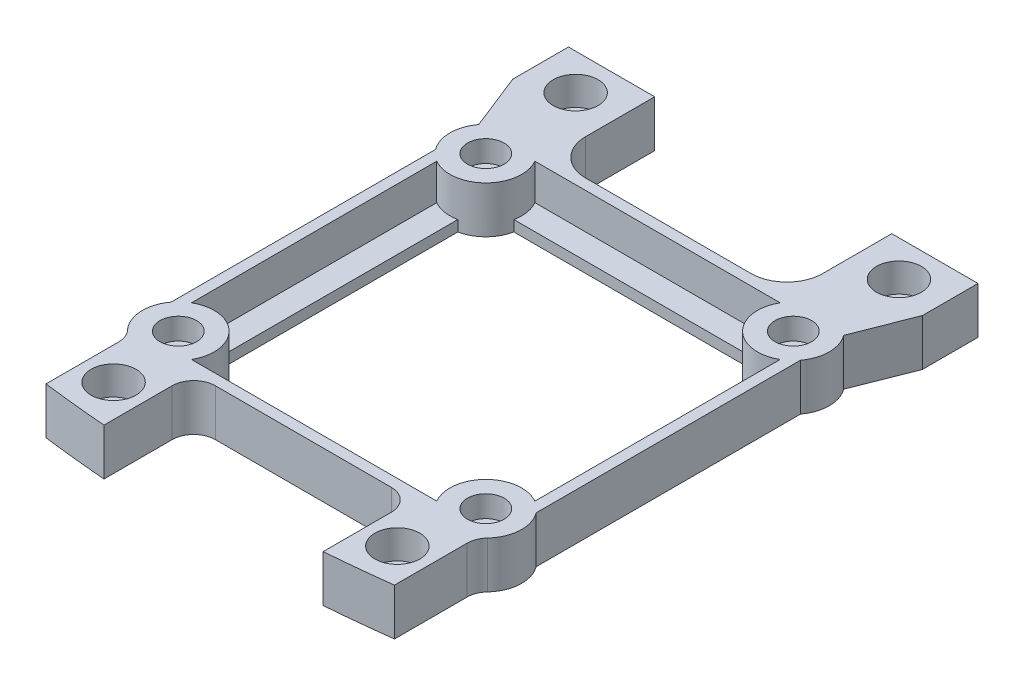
ISO-10303-21;
HEADER;
FILE_DESCRIPTION(('STEP AP214'),'2;1');
FILE_NAME('part.step','',(''),(''),'','','');
FILE_SCHEMA(('AUTOMOTIVE_DESIGN { 1 0 10303 214 1 1 1 1 }'));
ENDSEC;
DATA;
#1=APPLICATION_CONTEXT('core data for automotive mechanical design processes');
#2=APPLICATION_PROTOCOL_DEFINITION('international standard','automotive_design',2000,#1);
#3=PRODUCT_CONTEXT('',#1,'mechanical');
#4=PRODUCT('Part','Part','',(#3));
#5=PRODUCT_RELATED_PRODUCT_CATEGORY('part','',(#4));
#6=PRODUCT_DEFINITION_FORMATION('','',#4);
#7=PRODUCT_DEFINITION_CONTEXT('part definition',#1,'design');
#8=PRODUCT_DEFINITION('design','',#6,#7);
#9=PRODUCT_DEFINITION_SHAPE('','',#8);
#10=(LENGTH_UNIT() NAMED_UNIT(*) SI_UNIT(.MILLI.,.METRE.));
#11=(NAMED_UNIT(*) PLANE_ANGLE_UNIT() SI_UNIT($,.RADIAN.));
#12=(NAMED_UNIT(*) SI_UNIT($,.STERADIAN.) SOLID_ANGLE_UNIT());
#13=UNCERTAINTY_MEASURE_WITH_UNIT(LENGTH_MEASURE(1.E-05),#10,'distance_accuracy_value','');
#14=(GEOMETRIC_REPRESENTATION_CONTEXT(3) GLOBAL_UNCERTAINTY_ASSIGNED_CONTEXT((#13)) GLOBAL_UNIT_ASSIGNED_CONTEXT((#10,
#11,#12)) REPRESENTATION_CONTEXT('',''));
#15=CARTESIAN_POINT('',(0.,0.,0.));
#16=DIRECTION('',(0.,0.,1.));
#17=DIRECTION('',(1.,0.,0.));
#18=AXIS2_PLACEMENT_3D('',#15,#16,#17);
#19=CARTESIAN_POINT('',(25.4,1.5,25.4));
#20=DIRECTION('',(0.,0.,-1.));
#21=DIRECTION('',(-1.,0.,0.));
#22=AXIS2_PLACEMENT_3D('',#19,#20,#21);
#23=PLANE('',#22);
#24=DIRECTION('',(1.,0.,0.));
#25=VECTOR('',#24,1.);
#26=CARTESIAN_POINT('',(25.4,0.,25.4));
#27=LINE('',#26,#25);
#28=CARTESIAN_POINT('',(-12.25,0.,25.4));
#29=VERTEX_POINT('',#28);
#30=CARTESIAN_POINT('',(12.25,0.,25.4));
#31=VERTEX_POINT('',#30);
#32=EDGE_CURVE('E761',#29,#31,#27,.T.);
#33=ORIENTED_EDGE('',*,*,#32,.T.);
#34=DIRECTION('',(0.,1.,0.));
#35=VECTOR('',#34,1.);
#36=CARTESIAN_POINT('',(12.25,6.5,25.4));
#37=LINE('',#36,#35);
#38=CARTESIAN_POINT('',(12.25,6.5,25.4));
#39=VERTEX_POINT('',#38);
#40=EDGE_CURVE('E841',#31,#39,#37,.T.);
#41=ORIENTED_EDGE('',*,*,#40,.T.);
#42=DIRECTION('',(1.,0.,0.));
#43=VECTOR('',#42,1.);
#44=CARTESIAN_POINT('',(-25.4,6.5,25.4));
#45=LINE('',#44,#43);
#46=CARTESIAN_POINT('',(-12.25,6.5,25.4));
#47=VERTEX_POINT('',#46);
#48=EDGE_CURVE('E682',#47,#39,#45,.T.);
#49=ORIENTED_EDGE('',*,*,#48,.F.);
#50=DIRECTION('',(0.,1.,0.));
#51=VECTOR('',#50,1.);
#52=CARTESIAN_POINT('',(-12.25,1.5,25.4));
#53=LINE('',#52,#51);
#54=EDGE_CURVE('E838',#47,#29,#53,.F.);
#55=ORIENTED_EDGE('',*,*,#54,.T.);
#56=EDGE_LOOP('',(#33,#41,#49,#55));
#57=FACE_BOUND('',#56,.T.);
#58=ADVANCED_FACE('F43',(#57),#23,.F.);
#59=CARTESIAN_POINT('',(21.4,-14.142135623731,21.4));
#60=DIRECTION('',(0.,1.,0.));
#61=DIRECTION('',(0.,0.,1.));
#62=AXIS2_PLACEMENT_3D('',#59,#60,#61);
#63=CYLINDRICAL_SURFACE('',#62,5.);
#64=CARTESIAN_POINT('',(21.4,6.5,21.4));
#65=DIRECTION('',(0.,1.,0.));
#66=DIRECTION('',(0.,0.,1.));
#67=AXIS2_PLACEMENT_3D('',#64,#65,#66);
#68=CIRCLE('',#67,5.);
#69=CARTESIAN_POINT('',(25.05625,6.5,24.81054774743));
#70=VERTEX_POINT('',#69);
#71=CARTESIAN_POINT('',(25.4,6.5,18.4));
#72=VERTEX_POINT('',#71);
#73=EDGE_CURVE('E582',#70,#72,#68,.T.);
#74=ORIENTED_EDGE('',*,*,#73,.F.);
#75=DIRECTION('',(0.,1.,0.));
#76=VECTOR('',#75,1.);
#77=CARTESIAN_POINT('',(25.05625,-14.142135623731,24.81054774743));
#78=LINE('',#77,#76);
#79=CARTESIAN_POINT('',(25.05625,0.,24.81054774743));
#80=VERTEX_POINT('',#79);
#81=EDGE_CURVE('E835',#70,#80,#78,.F.);
#82=ORIENTED_EDGE('',*,*,#81,.T.);
#83=CARTESIAN_POINT('',(21.4,0.,21.4));
#84=DIRECTION('',(0.,1.,0.));
#85=DIRECTION('',(0.,0.,1.));
#86=AXIS2_PLACEMENT_3D('',#83,#84,#85);
#87=CIRCLE('',#86,5.);
#88=CARTESIAN_POINT('',(25.4,0.,18.4));
#89=VERTEX_POINT('',#88);
#90=EDGE_CURVE('E581',#89,#80,#87,.F.);
#91=ORIENTED_EDGE('',*,*,#90,.F.);
#92=DIRECTION('',(0.,1.,0.));
#93=VECTOR('',#92,1.);
#94=CARTESIAN_POINT('',(25.4,-14.142135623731,18.4));
#95=LINE('',#94,#93);
#96=EDGE_CURVE('E605',#72,#89,#95,.F.);
#97=ORIENTED_EDGE('',*,*,#96,.F.);
#98=EDGE_LOOP('',(#74,#82,#91,#97));
#99=FACE_BOUND('',#98,.T.);
#100=ADVANCED_FACE('F1010',(#99),#63,.T.);
#101=CARTESIAN_POINT('',(-22.5,-19.6814633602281,-35.));
#102=DIRECTION('',(0.,1.,0.));
#103=DIRECTION('',(0.,0.,1.));
#104=AXIS2_PLACEMENT_3D('',#101,#102,#103);
#105=CYLINDRICAL_SURFACE('',#104,1.55);
#106=CARTESIAN_POINT('',(-22.5,0.,-35.));
#107=DIRECTION('',(0.,1.,0.));
#108=DIRECTION('',(0.,0.,1.));
#109=AXIS2_PLACEMENT_3D('',#106,#107,#108);
#110=CIRCLE('',#109,1.55);
#111=CARTESIAN_POINT('',(-22.5,0.,-33.45));
#112=VERTEX_POINT('',#111);
#113=EDGE_CURVE('E442',#112,#112,#110,.T.);
#114=ORIENTED_EDGE('',*,*,#113,.F.);
#115=EDGE_LOOP('',(#114));
#116=FACE_BOUND('',#115,.T.);
#117=CARTESIAN_POINT('',(-22.5,2.5,-35.));
#118=DIRECTION('',(0.,1.,0.));
#119=DIRECTION('',(0.,0.,1.));
#120=AXIS2_PLACEMENT_3D('',#117,#118,#119);
#121=CIRCLE('',#120,1.55);
#122=CARTESIAN_POINT('',(-22.5,2.5,-33.45));
#123=VERTEX_POINT('',#122);
#124=EDGE_CURVE('E416',#123,#123,#121,.T.);
#125=ORIENTED_EDGE('',*,*,#124,.T.);
#126=EDGE_LOOP('',(#125));
#127=FACE_BOUND('',#126,.T.);
#128=ADVANCED_FACE('F1014',(#116,#127),#105,.F.);
#129=CARTESIAN_POINT('',(25.4,1.5,-25.4));
#130=DIRECTION('',(0.,0.,1.));
#131=DIRECTION('',(1.,0.,0.));
#132=AXIS2_PLACEMENT_3D('',#129,#130,#131);
#133=PLANE('',#132);
#134=DIRECTION('',(-1.,0.,0.));
#135=VECTOR('',#134,1.);
#136=CARTESIAN_POINT('',(25.4,6.5,-25.4));
#137=LINE('',#136,#135);
#138=CARTESIAN_POINT('',(11.5,6.5,-25.4));
#139=VERTEX_POINT('',#138);
#140=CARTESIAN_POINT('',(-11.5,6.5,-25.4));
#141=VERTEX_POINT('',#140);
#142=EDGE_CURVE('E699',#139,#141,#137,.T.);
#143=ORIENTED_EDGE('',*,*,#142,.F.);
#144=DIRECTION('',(0.,1.,0.));
#145=VECTOR('',#144,1.);
#146=CARTESIAN_POINT('',(11.5,1.5,-25.4));
#147=LINE('',#146,#145);
#148=CARTESIAN_POINT('',(11.5,0.,-25.4));
#149=VERTEX_POINT('',#148);
#150=EDGE_CURVE('E806',#139,#149,#147,.F.);
#151=ORIENTED_EDGE('',*,*,#150,.T.);
#152=DIRECTION('',(-1.,0.,0.));
#153=VECTOR('',#152,1.);
#154=CARTESIAN_POINT('',(25.4,0.,-25.4));
#155=LINE('',#154,#153);
#156=CARTESIAN_POINT('',(-11.5,0.,-25.4));
#157=VERTEX_POINT('',#156);
#158=EDGE_CURVE('E753',#149,#157,#155,.T.);
#159=ORIENTED_EDGE('',*,*,#158,.T.);
#160=DIRECTION('',(0.,1.,0.));
#161=VECTOR('',#160,1.);
#162=CARTESIAN_POINT('',(-11.5,6.5,-25.4));
#163=LINE('',#162,#161);
#164=EDGE_CURVE('E802',#157,#141,#163,.T.);
#165=ORIENTED_EDGE('',*,*,#164,.T.);
#166=EDGE_LOOP('',(#143,#151,#159,#165));
#167=FACE_BOUND('',#166,.T.);
#168=ADVANCED_FACE('F930',(#167),#133,.F.);
#169=CARTESIAN_POINT('',(-21.4,-14.142135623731,-21.4));
#170=DIRECTION('',(0.,1.,0.));
#171=DIRECTION('',(0.,0.,1.));
#172=AXIS2_PLACEMENT_3D('',#169,#170,#171);
#173=CYLINDRICAL_SURFACE('',#172,5.);
#174=CARTESIAN_POINT('',(-21.4,6.5,-21.4));
#175=DIRECTION('',(0.,1.,0.));
#176=DIRECTION('',(0.,0.,1.));
#177=AXIS2_PLACEMENT_3D('',#174,#175,#176);
#178=CIRCLE('',#177,5.);
#179=CARTESIAN_POINT('',(-25.4,6.5,-24.4));
#180=VERTEX_POINT('',#179);
#181=CARTESIAN_POINT('',(-25.4,6.5,-18.4));
#182=VERTEX_POINT('',#181);
#183=EDGE_CURVE('E648',#180,#182,#178,.T.);
#184=ORIENTED_EDGE('',*,*,#183,.F.);
#185=DIRECTION('',(0.,1.,0.));
#186=VECTOR('',#185,1.);
#187=CARTESIAN_POINT('',(-25.4,-19.6814633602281,-24.4));
#188=LINE('',#187,#186);
#189=CARTESIAN_POINT('',(-25.4,0.,-24.4));
#190=VERTEX_POINT('',#189);
#191=EDGE_CURVE('E425',#190,#180,#188,.T.);
#192=ORIENTED_EDGE('',*,*,#191,.F.);
#193=CARTESIAN_POINT('',(-21.4,0.,-21.4));
#194=DIRECTION('',(0.,1.,0.));
#195=DIRECTION('',(0.,0.,1.));
#196=AXIS2_PLACEMENT_3D('',#193,#194,#195);
#197=CIRCLE('',#196,5.);
#198=CARTESIAN_POINT('',(-25.4,0.,-18.4));
#199=VERTEX_POINT('',#198);
#200=EDGE_CURVE('E639',#199,#190,#197,.F.);
#201=ORIENTED_EDGE('',*,*,#200,.F.);
#202=DIRECTION('',(0.,1.,0.));
#203=VECTOR('',#202,1.);
#204=CARTESIAN_POINT('',(-25.4,-14.142135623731,-18.4));
#205=LINE('',#204,#203);
#206=EDGE_CURVE('E663',#182,#199,#205,.F.);
#207=ORIENTED_EDGE('',*,*,#206,.F.);
#208=EDGE_LOOP('',(#184,#192,#201,#207));
#209=FACE_BOUND('',#208,.T.);
#210=ADVANCED_FACE('F905',(#209),#173,.T.);
#211=CARTESIAN_POINT('',(22.5,-19.6814633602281,-35.));
#212=DIRECTION('',(0.,1.,0.));
#213=DIRECTION('',(0.,0.,1.));
#214=AXIS2_PLACEMENT_3D('',#211,#212,#213);
#215=CYLINDRICAL_SURFACE('',#214,1.55);
#216=CARTESIAN_POINT('',(22.5,0.,-35.));
#217=DIRECTION('',(0.,1.,0.));
#218=DIRECTION('',(0.,0.,1.));
#219=AXIS2_PLACEMENT_3D('',#216,#217,#218);
#220=CIRCLE('',#219,1.55);
#221=CARTESIAN_POINT('',(22.5,0.,-33.45));
#222=VERTEX_POINT('',#221);
#223=EDGE_CURVE('E489',#222,#222,#220,.F.);
#224=ORIENTED_EDGE('',*,*,#223,.T.);
#225=EDGE_LOOP('',(#224));
#226=FACE_BOUND('',#225,.T.);
#227=CARTESIAN_POINT('',(22.5,2.5,-35.));
#228=DIRECTION('',(0.,1.,0.));
#229=DIRECTION('',(0.,0.,1.));
#230=AXIS2_PLACEMENT_3D('',#227,#228,#229);
#231=CIRCLE('',#230,1.55);
#232=CARTESIAN_POINT('',(22.5,2.5,-33.45));
#233=VERTEX_POINT('',#232);
#234=EDGE_CURVE('E471',#233,#233,#231,.F.);
#235=ORIENTED_EDGE('',*,*,#234,.F.);
#236=EDGE_LOOP('',(#235));
#237=FACE_BOUND('',#236,.T.);
#238=ADVANCED_FACE('F1108',(#226,#237),#215,.F.);
#239=CARTESIAN_POINT('',(-21.4,1.5,-21.4));
#240=DIRECTION('',(0.,-1.,0.));
#241=DIRECTION('',(0.,0.,-1.));
#242=AXIS2_PLACEMENT_3D('',#239,#240,#241);
#243=CYLINDRICAL_SURFACE('',#242,1.375);
#244=CARTESIAN_POINT('',(-21.4,0.,-21.4));
#245=DIRECTION('',(0.,1.,0.));
#246=DIRECTION('',(0.,0.,1.));
#247=AXIS2_PLACEMENT_3D('',#244,#245,#246);
#248=CIRCLE('',#247,1.375);
#249=CARTESIAN_POINT('',(-21.4,0.,-20.025));
#250=VERTEX_POINT('',#249);
#251=EDGE_CURVE('E745',#250,#250,#248,.T.);
#252=ORIENTED_EDGE('',*,*,#251,.F.);
#253=EDGE_LOOP('',(#252));
#254=FACE_BOUND('',#253,.T.);
#255=CARTESIAN_POINT('',(-21.4,3.5,-21.4));
#256=DIRECTION('',(0.,1.,0.));
#257=DIRECTION('',(0.,0.,1.));
#258=AXIS2_PLACEMENT_3D('',#255,#256,#257);
#259=CIRCLE('',#258,1.375);
#260=CARTESIAN_POINT('',(-21.4,3.5,-20.025));
#261=VERTEX_POINT('',#260);
#262=EDGE_CURVE('E563',#261,#261,#259,.T.);
#263=ORIENTED_EDGE('',*,*,#262,.T.);
#264=EDGE_LOOP('',(#263));
#265=FACE_BOUND('',#264,.T.);
#266=ADVANCED_FACE('F1111',(#254,#265),#243,.F.);
#267=CARTESIAN_POINT('',(21.4,1.5,-21.4));
#268=DIRECTION('',(0.,-1.,0.));
#269=DIRECTION('',(0.,0.,-1.));
#270=AXIS2_PLACEMENT_3D('',#267,#268,#269);
#271=CYLINDRICAL_SURFACE('',#270,1.375);
#272=CARTESIAN_POINT('',(21.4,0.,-21.4));
#273=DIRECTION('',(0.,1.,0.));
#274=DIRECTION('',(0.,0.,1.));
#275=AXIS2_PLACEMENT_3D('',#272,#273,#274);
#276=CIRCLE('',#275,1.375);
#277=CARTESIAN_POINT('',(21.4,0.,-20.025));
#278=VERTEX_POINT('',#277);
#279=EDGE_CURVE('E741',#278,#278,#276,.T.);
#280=ORIENTED_EDGE('',*,*,#279,.F.);
#281=EDGE_LOOP('',(#280));
#282=FACE_BOUND('',#281,.T.);
#283=CARTESIAN_POINT('',(21.4,3.5,-21.4));
#284=DIRECTION('',(0.,1.,0.));
#285=DIRECTION('',(0.,0.,1.));
#286=AXIS2_PLACEMENT_3D('',#283,#284,#285);
#287=CIRCLE('',#286,1.375);
#288=CARTESIAN_POINT('',(21.4,3.5,-20.025));
#289=VERTEX_POINT('',#288);
#290=EDGE_CURVE('E786',#289,#289,#287,.T.);
#291=ORIENTED_EDGE('',*,*,#290,.T.);
#292=EDGE_LOOP('',(#291));
#293=FACE_BOUND('',#292,.T.);
#294=ADVANCED_FACE('F1208',(#282,#293),#271,.F.);
#295=CARTESIAN_POINT('',(21.4,1.5,21.4));
#296=DIRECTION('',(0.,-1.,0.));
#297=DIRECTION('',(0.,0.,-1.));
#298=AXIS2_PLACEMENT_3D('',#295,#296,#297);
#299=CYLINDRICAL_SURFACE('',#298,1.375);
#300=CARTESIAN_POINT('',(21.4,0.,21.4));
#301=DIRECTION('',(0.,1.,0.));
#302=DIRECTION('',(0.,0.,1.));
#303=AXIS2_PLACEMENT_3D('',#300,#301,#302);
#304=CIRCLE('',#303,1.375);
#305=CARTESIAN_POINT('',(21.4,0.,22.775));
#306=VERTEX_POINT('',#305);
#307=EDGE_CURVE('E737',#306,#306,#304,.T.);
#308=ORIENTED_EDGE('',*,*,#307,.F.);
#309=EDGE_LOOP('',(#308));
#310=FACE_BOUND('',#309,.T.);
#311=CARTESIAN_POINT('',(21.4,3.5,21.4));
#312=DIRECTION('',(0.,1.,0.));
#313=DIRECTION('',(0.,0.,1.));
#314=AXIS2_PLACEMENT_3D('',#311,#312,#313);
#315=CIRCLE('',#314,1.375);
#316=CARTESIAN_POINT('',(21.4,3.5,22.775));
#317=VERTEX_POINT('',#316);
#318=EDGE_CURVE('E782',#317,#317,#315,.T.);
#319=ORIENTED_EDGE('',*,*,#318,.T.);
#320=EDGE_LOOP('',(#319));
#321=FACE_BOUND('',#320,.T.);
#322=ADVANCED_FACE('F1204',(#310,#321),#299,.F.);
#323=CARTESIAN_POINT('',(-21.4,1.5,21.4));
#324=DIRECTION('',(0.,-1.,0.));
#325=DIRECTION('',(0.,0.,-1.));
#326=AXIS2_PLACEMENT_3D('',#323,#324,#325);
#327=CYLINDRICAL_SURFACE('',#326,1.375);
#328=CARTESIAN_POINT('',(-21.4,0.,21.4));
#329=DIRECTION('',(0.,1.,0.));
#330=DIRECTION('',(0.,0.,1.));
#331=AXIS2_PLACEMENT_3D('',#328,#329,#330);
#332=CIRCLE('',#331,1.375);
#333=CARTESIAN_POINT('',(-21.4,0.,22.775));
#334=VERTEX_POINT('',#333);
#335=EDGE_CURVE('E722',#334,#334,#332,.T.);
#336=ORIENTED_EDGE('',*,*,#335,.F.);
#337=EDGE_LOOP('',(#336));
#338=FACE_BOUND('',#337,.T.);
#339=CARTESIAN_POINT('',(-21.4,3.5,21.4));
#340=DIRECTION('',(0.,1.,0.));
#341=DIRECTION('',(0.,0.,1.));
#342=AXIS2_PLACEMENT_3D('',#339,#340,#341);
#343=CIRCLE('',#342,1.375);
#344=CARTESIAN_POINT('',(-21.4,3.5,22.775));
#345=VERTEX_POINT('',#344);
#346=EDGE_CURVE('E550',#345,#345,#343,.T.);
#347=ORIENTED_EDGE('',*,*,#346,.T.);
#348=EDGE_LOOP('',(#347));
#349=FACE_BOUND('',#348,.T.);
#350=ADVANCED_FACE('F1201',(#338,#349),#327,.F.);
#351=CARTESIAN_POINT('',(0.,1.5,0.));
#352=DIRECTION('',(0.,1.,0.));
#353=DIRECTION('',(0.,0.,1.));
#354=AXIS2_PLACEMENT_3D('',#351,#352,#353);
#355=PLANE('',#354);
#356=CARTESIAN_POINT('',(-21.4,1.5,21.4));
#357=DIRECTION('',(0.,1.,0.));
#358=DIRECTION('',(0.,0.,1.));
#359=AXIS2_PLACEMENT_3D('',#356,#357,#358);
#360=CIRCLE('',#359,5.);
#361=CARTESIAN_POINT('',(-17.0698729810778,1.5,23.9));
#362=VERTEX_POINT('',#361);
#363=CARTESIAN_POINT('',(-16.5010205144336,1.5,20.4));
#364=VERTEX_POINT('',#363);
#365=EDGE_CURVE('E564',#362,#364,#360,.T.);
#366=ORIENTED_EDGE('',*,*,#365,.F.);
#367=DIRECTION('',(1.,0.,0.));
#368=VECTOR('',#367,1.);
#369=CARTESIAN_POINT('',(-23.9,1.5,23.9));
#370=LINE('',#369,#368);
#371=CARTESIAN_POINT('',(17.0698729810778,1.5,23.9));
#372=VERTEX_POINT('',#371);
#373=EDGE_CURVE('E672',#362,#372,#370,.T.);
#374=ORIENTED_EDGE('',*,*,#373,.T.);
#375=CARTESIAN_POINT('',(21.4,1.5,21.4));
#376=DIRECTION('',(0.,1.,0.));
#377=DIRECTION('',(0.,0.,1.));
#378=AXIS2_PLACEMENT_3D('',#375,#376,#377);
#379=CIRCLE('',#378,5.);
#380=CARTESIAN_POINT('',(16.5010205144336,1.5,20.4));
#381=VERTEX_POINT('',#380);
#382=EDGE_CURVE('E590',#381,#372,#379,.T.);
#383=ORIENTED_EDGE('',*,*,#382,.F.);
#384=DIRECTION('',(1.,0.,0.));
#385=VECTOR('',#384,1.);
#386=CARTESIAN_POINT('',(20.4,1.5,20.4));
#387=LINE('',#386,#385);
#388=EDGE_CURVE('E719',#364,#381,#387,.T.);
#389=ORIENTED_EDGE('',*,*,#388,.F.);
#390=EDGE_LOOP('',(#366,#374,#383,#389));
#391=FACE_BOUND('',#390,.T.);
#392=ADVANCED_FACE('F1007',(#391),#355,.T.);
#393=CARTESIAN_POINT('',(23.9,1.5,17.0698729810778));
#394=VERTEX_POINT('',#393);
#395=CARTESIAN_POINT('',(20.4,1.5,16.5010205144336));
#396=VERTEX_POINT('',#395);
#397=EDGE_CURVE('E595',#394,#396,#379,.T.);
#398=ORIENTED_EDGE('',*,*,#397,.F.);
#399=DIRECTION('',(0.,0.,-1.));
#400=VECTOR('',#399,1.);
#401=CARTESIAN_POINT('',(23.9,1.5,23.9));
#402=LINE('',#401,#400);
#403=CARTESIAN_POINT('',(23.9,1.5,-17.0698729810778));
#404=VERTEX_POINT('',#403);
#405=EDGE_CURVE('E667',#394,#404,#402,.T.);
#406=ORIENTED_EDGE('',*,*,#405,.T.);
#407=CARTESIAN_POINT('',(21.4,1.5,-21.4));
#408=DIRECTION('',(0.,1.,0.));
#409=DIRECTION('',(0.,0.,1.));
#410=AXIS2_PLACEMENT_3D('',#407,#408,#409);
#411=CIRCLE('',#410,5.);
#412=CARTESIAN_POINT('',(20.4,1.5,-16.5010205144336));
#413=VERTEX_POINT('',#412);
#414=EDGE_CURVE('E623',#413,#404,#411,.T.);
#415=ORIENTED_EDGE('',*,*,#414,.F.);
#416=DIRECTION('',(0.,0.,-1.));
#417=VECTOR('',#416,1.);
#418=CARTESIAN_POINT('',(20.4,1.5,20.4));
#419=LINE('',#418,#417);
#420=EDGE_CURVE('E708',#396,#413,#419,.T.);
#421=ORIENTED_EDGE('',*,*,#420,.F.);
#422=EDGE_LOOP('',(#398,#406,#415,#421));
#423=FACE_BOUND('',#422,.T.);
#424=ADVANCED_FACE('F1250',(#423),#355,.T.);
#425=CARTESIAN_POINT('',(17.0698729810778,1.5,-23.9));
#426=VERTEX_POINT('',#425);
#427=CARTESIAN_POINT('',(16.5010205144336,1.5,-20.4));
#428=VERTEX_POINT('',#427);
#429=EDGE_CURVE('E619',#426,#428,#411,.T.);
#430=ORIENTED_EDGE('',*,*,#429,.F.);
#431=DIRECTION('',(-1.,0.,0.));
#432=VECTOR('',#431,1.);
#433=CARTESIAN_POINT('',(23.9,1.5,-23.9));
#434=LINE('',#433,#432);
#435=CARTESIAN_POINT('',(-17.0698729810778,1.5,-23.9));
#436=VERTEX_POINT('',#435);
#437=EDGE_CURVE('E685',#426,#436,#434,.T.);
#438=ORIENTED_EDGE('',*,*,#437,.T.);
#439=CARTESIAN_POINT('',(-21.4,1.5,-21.4));
#440=DIRECTION('',(0.,1.,0.));
#441=DIRECTION('',(0.,0.,1.));
#442=AXIS2_PLACEMENT_3D('',#439,#440,#441);
#443=CIRCLE('',#442,5.);
#444=CARTESIAN_POINT('',(-16.5010205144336,1.5,-20.4));
#445=VERTEX_POINT('',#444);
#446=EDGE_CURVE('E652',#445,#436,#443,.T.);
#447=ORIENTED_EDGE('',*,*,#446,.F.);
#448=DIRECTION('',(-1.,0.,0.));
#449=VECTOR('',#448,1.);
#450=CARTESIAN_POINT('',(20.4,1.5,-20.4));
#451=LINE('',#450,#449);
#452=EDGE_CURVE('E711',#428,#445,#451,.T.);
#453=ORIENTED_EDGE('',*,*,#452,.F.);
#454=EDGE_LOOP('',(#430,#438,#447,#453));
#455=FACE_BOUND('',#454,.T.);
#456=ADVANCED_FACE('F1004',(#455),#355,.T.);
#457=CARTESIAN_POINT('',(-20.4,1.5,16.5010205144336));
#458=VERTEX_POINT('',#457);
#459=CARTESIAN_POINT('',(-23.9,1.5,17.0698729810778));
#460=VERTEX_POINT('',#459);
#461=EDGE_CURVE('E568',#458,#460,#360,.T.);
#462=ORIENTED_EDGE('',*,*,#461,.F.);
#463=DIRECTION('',(0.,0.,1.));
#464=VECTOR('',#463,1.);
#465=CARTESIAN_POINT('',(-20.4,1.5,20.4));
#466=LINE('',#465,#464);
#467=CARTESIAN_POINT('',(-20.4,1.5,-16.5010205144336));
#468=VERTEX_POINT('',#467);
#469=EDGE_CURVE('E715',#468,#458,#466,.T.);
#470=ORIENTED_EDGE('',*,*,#469,.F.);
#471=CARTESIAN_POINT('',(-23.9,1.5,-17.0698729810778));
#472=VERTEX_POINT('',#471);
#473=EDGE_CURVE('E643',#472,#468,#443,.T.);
#474=ORIENTED_EDGE('',*,*,#473,.F.);
#475=DIRECTION('',(0.,0.,1.));
#476=VECTOR('',#475,1.);
#477=CARTESIAN_POINT('',(-23.9,1.5,-23.9));
#478=LINE('',#477,#476);
#479=EDGE_CURVE('E688',#472,#460,#478,.T.);
#480=ORIENTED_EDGE('',*,*,#479,.T.);
#481=EDGE_LOOP('',(#462,#470,#474,#480));
#482=FACE_BOUND('',#481,.T.);
#483=ADVANCED_FACE('F996',(#482),#355,.T.);
#484=CARTESIAN_POINT('',(0.,0.,0.));
#485=DIRECTION('',(0.,1.,0.));
#486=DIRECTION('',(0.,0.,1.));
#487=AXIS2_PLACEMENT_3D('',#484,#485,#486);
#488=PLANE('',#487);
#489=CARTESIAN_POINT('',(19.75,0.,32.06));
#490=DIRECTION('',(0.,-1.,0.));
#491=DIRECTION('',(0.,0.,1.));
#492=AXIS2_PLACEMENT_3D('',#489,#490,#491);
#493=CIRCLE('',#492,1.55);
#494=CARTESIAN_POINT('',(19.75,0.,33.61));
#495=VERTEX_POINT('',#494);
#496=EDGE_CURVE('E981',#495,#495,#493,.T.);
#497=ORIENTED_EDGE('',*,*,#496,.F.);
#498=EDGE_LOOP('',(#497));
#499=FACE_BOUND('',#498,.T.);
#500=DIRECTION('',(0.,0.,1.));
#501=VECTOR('',#500,1.);
#502=CARTESIAN_POINT('',(15.25,0.,25.4));
#503=LINE('',#502,#501);
#504=CARTESIAN_POINT('',(15.25,0.,28.4));
#505=VERTEX_POINT('',#504);
#506=CARTESIAN_POINT('',(15.25,0.,37.8934102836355));
#507=VERTEX_POINT('',#506);
#508=EDGE_CURVE('E331',#505,#507,#503,.T.);
#509=ORIENTED_EDGE('',*,*,#508,.F.);
#510=CARTESIAN_POINT('',(12.25,0.,28.4));
#511=DIRECTION('',(0.,1.,0.));
#512=DIRECTION('',(0.,0.,1.));
#513=AXIS2_PLACEMENT_3D('',#510,#511,#512);
#514=CIRCLE('',#513,3.);
#515=EDGE_CURVE('E865',#505,#31,#514,.T.);
#516=ORIENTED_EDGE('',*,*,#515,.T.);
#517=ORIENTED_EDGE('',*,*,#32,.F.);
#518=CARTESIAN_POINT('',(-12.25,0.,28.4));
#519=DIRECTION('',(0.,1.,0.));
#520=DIRECTION('',(0.,0.,1.));
#521=AXIS2_PLACEMENT_3D('',#518,#519,#520);
#522=CIRCLE('',#521,3.);
#523=CARTESIAN_POINT('',(-15.25,0.,28.4));
#524=VERTEX_POINT('',#523);
#525=EDGE_CURVE('E11',#29,#524,#522,.T.);
#526=ORIENTED_EDGE('',*,*,#525,.T.);
#527=DIRECTION('',(0.,0.,1.));
#528=VECTOR('',#527,1.);
#529=CARTESIAN_POINT('',(-15.25,0.,25.4));
#530=LINE('',#529,#528);
#531=CARTESIAN_POINT('',(-15.25,0.,37.8934102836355));
#532=VERTEX_POINT('',#531);
#533=EDGE_CURVE('E388',#524,#532,#530,.T.);
#534=ORIENTED_EDGE('',*,*,#533,.T.);
#535=CARTESIAN_POINT('',(0.,0.,-153.5));
#536=DIRECTION('',(0.,1.,0.));
#537=DIRECTION('',(0.,0.,1.));
#538=AXIS2_PLACEMENT_3D('',#535,#536,#537);
#539=CIRCLE('',#538,192.);
#540=CARTESIAN_POINT('',(-24.25,0.,36.9624306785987));
#541=VERTEX_POINT('',#540);
#542=EDGE_CURVE('E385',#532,#541,#539,.F.);
#543=ORIENTED_EDGE('',*,*,#542,.T.);
#544=DIRECTION('',(0.,0.,-1.));
#545=VECTOR('',#544,1.);
#546=CARTESIAN_POINT('',(-24.25,0.,25.5082234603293));
#547=LINE('',#546,#545);
#548=CARTESIAN_POINT('',(-24.25,0.,26.856876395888));
#549=VERTEX_POINT('',#548);
#550=EDGE_CURVE('E392',#541,#549,#547,.T.);
#551=ORIENTED_EDGE('',*,*,#550,.T.);
#552=CARTESIAN_POINT('',(-27.25,0.,26.856876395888));
#553=DIRECTION('',(0.,1.,0.));
#554=DIRECTION('',(0.,0.,1.));
#555=AXIS2_PLACEMENT_3D('',#552,#553,#554);
#556=CIRCLE('',#555,3.);
#557=CARTESIAN_POINT('',(-25.05625,0.,24.81054774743));
#558=VERTEX_POINT('',#557);
#559=EDGE_CURVE('E854',#549,#558,#556,.T.);
#560=ORIENTED_EDGE('',*,*,#559,.T.);
#561=CARTESIAN_POINT('',(-21.4,0.,21.4));
#562=DIRECTION('',(0.,1.,0.));
#563=DIRECTION('',(0.,0.,1.));
#564=AXIS2_PLACEMENT_3D('',#561,#562,#563);
#565=CIRCLE('',#564,5.);
#566=CARTESIAN_POINT('',(-25.4,0.,18.4));
#567=VERTEX_POINT('',#566);
#568=EDGE_CURVE('E560',#558,#567,#565,.F.);
#569=ORIENTED_EDGE('',*,*,#568,.T.);
#570=DIRECTION('',(0.,0.,1.));
#571=VECTOR('',#570,1.);
#572=CARTESIAN_POINT('',(-25.4,0.,25.4));
#573=LINE('',#572,#571);
#574=EDGE_CURVE('E757',#199,#567,#573,.T.);
#575=ORIENTED_EDGE('',*,*,#574,.F.);
#576=ORIENTED_EDGE('',*,*,#200,.T.);
#577=DIRECTION('',(0.367301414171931,0.,0.930101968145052));
#578=VECTOR('',#577,1.);
#579=CARTESIAN_POINT('',(-28.5,0.,-32.25));
#580=LINE('',#579,#578);
#581=CARTESIAN_POINT('',(-28.5,0.,-32.25));
#582=VERTEX_POINT('',#581);
#583=EDGE_CURVE('E446',#582,#190,#580,.T.);
#584=ORIENTED_EDGE('',*,*,#583,.F.);
#585=DIRECTION('',(0.,0.,1.));
#586=VECTOR('',#585,1.);
#587=CARTESIAN_POINT('',(-28.5,0.,-40.));
#588=LINE('',#587,#586);
#589=CARTESIAN_POINT('',(-28.5,0.,-40.));
#590=VERTEX_POINT('',#589);
#591=EDGE_CURVE('E424',#590,#582,#588,.T.);
#592=ORIENTED_EDGE('',*,*,#591,.F.);
#593=DIRECTION('',(-1.,0.,0.));
#594=VECTOR('',#593,1.);
#595=CARTESIAN_POINT('',(-16.5,0.,-40.));
#596=LINE('',#595,#594);
#597=CARTESIAN_POINT('',(-16.5,0.,-40.));
#598=VERTEX_POINT('',#597);
#599=EDGE_CURVE('E430',#598,#590,#596,.T.);
#600=ORIENTED_EDGE('',*,*,#599,.F.);
#601=DIRECTION('',(0.,0.,-1.));
#602=VECTOR('',#601,1.);
#603=CARTESIAN_POINT('',(-16.5,0.,-25.4));
#604=LINE('',#603,#602);
#605=CARTESIAN_POINT('',(-16.5,0.,-30.4));
#606=VERTEX_POINT('',#605);
#607=EDGE_CURVE('E436',#606,#598,#604,.T.);
#608=ORIENTED_EDGE('',*,*,#607,.F.);
#609=CARTESIAN_POINT('',(-11.5,0.,-30.4));
#610=DIRECTION('',(0.,1.,0.));
#611=DIRECTION('',(0.,0.,1.));
#612=AXIS2_PLACEMENT_3D('',#609,#610,#611);
#613=CIRCLE('',#612,5.);
#614=EDGE_CURVE('E821',#606,#157,#613,.T.);
#615=ORIENTED_EDGE('',*,*,#614,.T.);
#616=ORIENTED_EDGE('',*,*,#158,.F.);
#617=CARTESIAN_POINT('',(11.5,0.,-30.4));
#618=DIRECTION('',(0.,1.,0.));
#619=DIRECTION('',(0.,0.,1.));
#620=AXIS2_PLACEMENT_3D('',#617,#618,#619);
#621=CIRCLE('',#620,5.);
#622=CARTESIAN_POINT('',(16.5,0.,-30.4));
#623=VERTEX_POINT('',#622);
#624=EDGE_CURVE('E815',#149,#623,#621,.T.);
#625=ORIENTED_EDGE('',*,*,#624,.T.);
#626=DIRECTION('',(0.,0.,-1.));
#627=VECTOR('',#626,1.);
#628=CARTESIAN_POINT('',(16.5,0.,-25.4));
#629=LINE('',#628,#627);
#630=CARTESIAN_POINT('',(16.5,0.,-40.));
#631=VERTEX_POINT('',#630);
#632=EDGE_CURVE('E486',#623,#631,#629,.T.);
#633=ORIENTED_EDGE('',*,*,#632,.T.);
#634=DIRECTION('',(1.,0.,0.));
#635=VECTOR('',#634,1.);
#636=CARTESIAN_POINT('',(16.5,0.,-40.));
#637=LINE('',#636,#635);
#638=CARTESIAN_POINT('',(28.5,0.,-40.));
#639=VERTEX_POINT('',#638);
#640=EDGE_CURVE('E483',#631,#639,#637,.T.);
#641=ORIENTED_EDGE('',*,*,#640,.T.);
#642=DIRECTION('',(0.,0.,1.));
#643=VECTOR('',#642,1.);
#644=CARTESIAN_POINT('',(28.5,0.,-40.));
#645=LINE('',#644,#643);
#646=CARTESIAN_POINT('',(28.5,0.,-32.25));
#647=VERTEX_POINT('',#646);
#648=EDGE_CURVE('E479',#639,#647,#645,.T.);
#649=ORIENTED_EDGE('',*,*,#648,.T.);
#650=DIRECTION('',(-0.367301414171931,0.,0.930101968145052));
#651=VECTOR('',#650,1.);
#652=CARTESIAN_POINT('',(28.5,0.,-32.25));
#653=LINE('',#652,#651);
#654=CARTESIAN_POINT('',(25.4,0.,-24.4));
#655=VERTEX_POINT('',#654);
#656=EDGE_CURVE('E475',#647,#655,#653,.T.);
#657=ORIENTED_EDGE('',*,*,#656,.T.);
#658=CARTESIAN_POINT('',(21.4,0.,-21.4));
#659=DIRECTION('',(0.,1.,0.));
#660=DIRECTION('',(0.,0.,1.));
#661=AXIS2_PLACEMENT_3D('',#658,#659,#660);
#662=CIRCLE('',#661,5.);
#663=CARTESIAN_POINT('',(25.4,0.,-18.4));
#664=VERTEX_POINT('',#663);
#665=EDGE_CURVE('E609',#655,#664,#662,.F.);
#666=ORIENTED_EDGE('',*,*,#665,.T.);
#667=DIRECTION('',(0.,0.,-1.));
#668=VECTOR('',#667,1.);
#669=CARTESIAN_POINT('',(25.4,0.,25.4));
#670=LINE('',#669,#668);
#671=EDGE_CURVE('E749',#89,#664,#670,.T.);
#672=ORIENTED_EDGE('',*,*,#671,.F.);
#673=ORIENTED_EDGE('',*,*,#90,.T.);
#674=CARTESIAN_POINT('',(27.25,0.,26.856876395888));
#675=DIRECTION('',(0.,1.,0.));
#676=DIRECTION('',(0.,0.,1.));
#677=AXIS2_PLACEMENT_3D('',#674,#675,#676);
#678=CIRCLE('',#677,3.);
#679=CARTESIAN_POINT('',(24.25,0.,26.856876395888));
#680=VERTEX_POINT('',#679);
#681=EDGE_CURVE('E860',#80,#680,#678,.T.);
#682=ORIENTED_EDGE('',*,*,#681,.T.);
#683=DIRECTION('',(0.,0.,-1.));
#684=VECTOR('',#683,1.);
#685=CARTESIAN_POINT('',(24.25,0.,25.5082234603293));
#686=LINE('',#685,#684);
#687=CARTESIAN_POINT('',(24.25,0.,36.9624306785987));
#688=VERTEX_POINT('',#687);
#689=EDGE_CURVE('E361',#688,#680,#686,.T.);
#690=ORIENTED_EDGE('',*,*,#689,.F.);
#691=CARTESIAN_POINT('',(0.,0.,-153.5));
#692=DIRECTION('',(0.,1.,0.));
#693=DIRECTION('',(0.,0.,1.));
#694=AXIS2_PLACEMENT_3D('',#691,#692,#693);
#695=CIRCLE('',#694,192.);
#696=EDGE_CURVE('E975',#507,#688,#695,.T.);
#697=ORIENTED_EDGE('',*,*,#696,.F.);
#698=EDGE_LOOP('',(#509,#516,#517,#526,#534,#543,#551,#560,#569,#575,#576,#584,#592,#600,#608,
#615,#616,#625,#633,#641,#649,#657,#666,#672,#673,#682,#690,#697));
#699=FACE_BOUND('',#698,.T.);
#700=CARTESIAN_POINT('',(-19.75,0.,32.06));
#701=DIRECTION('',(0.,1.,0.));
#702=DIRECTION('',(0.,0.,1.));
#703=AXIS2_PLACEMENT_3D('',#700,#701,#702);
#704=CIRCLE('',#703,1.55);
#705=CARTESIAN_POINT('',(-19.75,0.,33.61));
#706=VERTEX_POINT('',#705);
#707=EDGE_CURVE('E368',#706,#706,#704,.T.);
#708=ORIENTED_EDGE('',*,*,#707,.T.);
#709=EDGE_LOOP('',(#708));
#710=FACE_BOUND('',#709,.T.);
#711=CARTESIAN_POINT('',(-20.4,0.,16.5010205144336));
#712=VERTEX_POINT('',#711);
#713=CARTESIAN_POINT('',(-16.5010205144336,0.,20.4));
#714=VERTEX_POINT('',#713);
#715=EDGE_CURVE('E559',#712,#714,#565,.F.);
#716=ORIENTED_EDGE('',*,*,#715,.T.);
#717=DIRECTION('',(1.,0.,0.));
#718=VECTOR('',#717,1.);
#719=CARTESIAN_POINT('',(20.4,0.,20.4));
#720=LINE('',#719,#718);
#721=CARTESIAN_POINT('',(16.5010205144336,0.,20.4));
#722=VERTEX_POINT('',#721);
#723=EDGE_CURVE('E712',#714,#722,#720,.T.);
#724=ORIENTED_EDGE('',*,*,#723,.T.);
#725=CARTESIAN_POINT('',(20.4,0.,16.5010205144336));
#726=VERTEX_POINT('',#725);
#727=EDGE_CURVE('E586',#722,#726,#87,.F.);
#728=ORIENTED_EDGE('',*,*,#727,.T.);
#729=DIRECTION('',(0.,0.,-1.));
#730=VECTOR('',#729,1.);
#731=CARTESIAN_POINT('',(20.4,0.,20.4));
#732=LINE('',#731,#730);
#733=CARTESIAN_POINT('',(20.4,0.,-16.5010205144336));
#734=VERTEX_POINT('',#733);
#735=EDGE_CURVE('E707',#726,#734,#732,.T.);
#736=ORIENTED_EDGE('',*,*,#735,.T.);
#737=CARTESIAN_POINT('',(16.5010205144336,0.,-20.4));
#738=VERTEX_POINT('',#737);
#739=EDGE_CURVE('E615',#734,#738,#662,.F.);
#740=ORIENTED_EDGE('',*,*,#739,.T.);
#741=DIRECTION('',(-1.,0.,0.));
#742=VECTOR('',#741,1.);
#743=CARTESIAN_POINT('',(20.4,0.,-20.4));
#744=LINE('',#743,#742);
#745=CARTESIAN_POINT('',(-16.5010205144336,0.,-20.4));
#746=VERTEX_POINT('',#745);
#747=EDGE_CURVE('E725',#738,#746,#744,.T.);
#748=ORIENTED_EDGE('',*,*,#747,.T.);
#749=CARTESIAN_POINT('',(-20.4,0.,-16.5010205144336));
#750=VERTEX_POINT('',#749);
#751=EDGE_CURVE('E644',#746,#750,#197,.F.);
#752=ORIENTED_EDGE('',*,*,#751,.T.);
#753=DIRECTION('',(0.,0.,1.));
#754=VECTOR('',#753,1.);
#755=CARTESIAN_POINT('',(-20.4,0.,20.4));
#756=LINE('',#755,#754);
#757=EDGE_CURVE('E728',#750,#712,#756,.T.);
#758=ORIENTED_EDGE('',*,*,#757,.T.);
#759=EDGE_LOOP('',(#716,#724,#728,#736,#740,#748,#752,#758));
#760=FACE_BOUND('',#759,.T.);
#761=ORIENTED_EDGE('',*,*,#251,.T.);
#762=EDGE_LOOP('',(#761));
#763=FACE_BOUND('',#762,.T.);
#764=ORIENTED_EDGE('',*,*,#279,.T.);
#765=EDGE_LOOP('',(#764));
#766=FACE_BOUND('',#765,.T.);
#767=ORIENTED_EDGE('',*,*,#307,.T.);
#768=EDGE_LOOP('',(#767));
#769=FACE_BOUND('',#768,.T.);
#770=ORIENTED_EDGE('',*,*,#335,.T.);
#771=EDGE_LOOP('',(#770));
#772=FACE_BOUND('',#771,.T.);
#773=ORIENTED_EDGE('',*,*,#223,.F.);
#774=EDGE_LOOP('',(#773));
#775=FACE_BOUND('',#774,.T.);
#776=ORIENTED_EDGE('',*,*,#113,.T.);
#777=EDGE_LOOP('',(#776));
#778=FACE_BOUND('',#777,.T.);
#779=ADVANCED_FACE('F876',(#499,#699,#710,#760,#763,#766,#769,#772,#775,#778),#488,.F.);
#780=CARTESIAN_POINT('',(25.4,1.5,25.4));
#781=DIRECTION('',(-1.,0.,0.));
#782=DIRECTION('',(0.,0.,1.));
#783=AXIS2_PLACEMENT_3D('',#780,#781,#782);
#784=PLANE('',#783);
#785=DIRECTION('',(0.,0.,-1.));
#786=VECTOR('',#785,1.);
#787=CARTESIAN_POINT('',(25.4,6.5,25.4));
#788=LINE('',#787,#786);
#789=CARTESIAN_POINT('',(25.4,6.5,-18.4));
#790=VERTEX_POINT('',#789);
#791=EDGE_CURVE('E696',#72,#790,#788,.T.);
#792=ORIENTED_EDGE('',*,*,#791,.F.);
#793=ORIENTED_EDGE('',*,*,#96,.T.);
#794=ORIENTED_EDGE('',*,*,#671,.T.);
#795=DIRECTION('',(0.,1.,0.));
#796=VECTOR('',#795,1.);
#797=CARTESIAN_POINT('',(25.4,-14.142135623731,-18.4));
#798=LINE('',#797,#796);
#799=EDGE_CURVE('E634',#664,#790,#798,.T.);
#800=ORIENTED_EDGE('',*,*,#799,.T.);
#801=EDGE_LOOP('',(#792,#793,#794,#800));
#802=FACE_BOUND('',#801,.T.);
#803=ADVANCED_FACE('F995',(#802),#784,.F.);
#804=CARTESIAN_POINT('',(-25.4,1.5,25.4));
#805=DIRECTION('',(1.,0.,0.));
#806=DIRECTION('',(0.,0.,-1.));
#807=AXIS2_PLACEMENT_3D('',#804,#805,#806);
#808=PLANE('',#807);
#809=ORIENTED_EDGE('',*,*,#574,.T.);
#810=DIRECTION('',(0.,1.,0.));
#811=VECTOR('',#810,1.);
#812=CARTESIAN_POINT('',(-25.4,-14.142135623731,18.4));
#813=LINE('',#812,#811);
#814=CARTESIAN_POINT('',(-25.4,6.5,18.4));
#815=VERTEX_POINT('',#814);
#816=EDGE_CURVE('E577',#567,#815,#813,.T.);
#817=ORIENTED_EDGE('',*,*,#816,.T.);
#818=DIRECTION('',(0.,0.,1.));
#819=VECTOR('',#818,1.);
#820=CARTESIAN_POINT('',(-25.4,6.5,-25.4));
#821=LINE('',#820,#819);
#822=EDGE_CURVE('E703',#182,#815,#821,.T.);
#823=ORIENTED_EDGE('',*,*,#822,.F.);
#824=ORIENTED_EDGE('',*,*,#206,.T.);
#825=EDGE_LOOP('',(#809,#817,#823,#824));
#826=FACE_BOUND('',#825,.T.);
#827=ADVANCED_FACE('F900',(#826),#808,.F.);
#828=CARTESIAN_POINT('',(20.4,1.5,20.4));
#829=DIRECTION('',(-1.,0.,0.));
#830=DIRECTION('',(0.,0.,1.));
#831=AXIS2_PLACEMENT_3D('',#828,#829,#830);
#832=PLANE('',#831);
#833=DIRECTION('',(0.,1.,0.));
#834=VECTOR('',#833,1.);
#835=CARTESIAN_POINT('',(20.4,-14.142135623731,16.5010205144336));
#836=LINE('',#835,#834);
#837=EDGE_CURVE('E602',#396,#726,#836,.F.);
#838=ORIENTED_EDGE('',*,*,#837,.F.);
#839=ORIENTED_EDGE('',*,*,#420,.T.);
#840=DIRECTION('',(0.,1.,0.));
#841=VECTOR('',#840,1.);
#842=CARTESIAN_POINT('',(20.4,-14.142135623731,-16.5010205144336));
#843=LINE('',#842,#841);
#844=EDGE_CURVE('E630',#734,#413,#843,.T.);
#845=ORIENTED_EDGE('',*,*,#844,.F.);
#846=ORIENTED_EDGE('',*,*,#735,.F.);
#847=EDGE_LOOP('',(#838,#839,#845,#846));
#848=FACE_BOUND('',#847,.T.);
#849=ADVANCED_FACE('F1021',(#848),#832,.T.);
#850=CARTESIAN_POINT('',(20.4,1.5,-20.4));
#851=DIRECTION('',(0.,0.,1.));
#852=DIRECTION('',(1.,0.,0.));
#853=AXIS2_PLACEMENT_3D('',#850,#851,#852);
#854=PLANE('',#853);
#855=DIRECTION('',(0.,1.,0.));
#856=VECTOR('',#855,1.);
#857=CARTESIAN_POINT('',(16.5010205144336,-14.142135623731,-20.4));
#858=LINE('',#857,#856);
#859=EDGE_CURVE('E622',#428,#738,#858,.F.);
#860=ORIENTED_EDGE('',*,*,#859,.F.);
#861=ORIENTED_EDGE('',*,*,#452,.T.);
#862=DIRECTION('',(0.,1.,0.));
#863=VECTOR('',#862,1.);
#864=CARTESIAN_POINT('',(-16.5010205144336,-14.142135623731,-20.4));
#865=LINE('',#864,#863);
#866=EDGE_CURVE('E659',#746,#445,#865,.T.);
#867=ORIENTED_EDGE('',*,*,#866,.F.);
#868=ORIENTED_EDGE('',*,*,#747,.F.);
#869=EDGE_LOOP('',(#860,#861,#867,#868));
#870=FACE_BOUND('',#869,.T.);
#871=ADVANCED_FACE('F1193',(#870),#854,.T.);
#872=CARTESIAN_POINT('',(-20.4,1.5,20.4));
#873=DIRECTION('',(1.,0.,0.));
#874=DIRECTION('',(0.,0.,-1.));
#875=AXIS2_PLACEMENT_3D('',#872,#873,#874);
#876=PLANE('',#875);
#877=DIRECTION('',(0.,1.,0.));
#878=VECTOR('',#877,1.);
#879=CARTESIAN_POINT('',(-20.4,-14.142135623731,16.5010205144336));
#880=LINE('',#879,#878);
#881=EDGE_CURVE('E574',#712,#458,#880,.T.);
#882=ORIENTED_EDGE('',*,*,#881,.F.);
#883=ORIENTED_EDGE('',*,*,#757,.F.);
#884=DIRECTION('',(0.,1.,0.));
#885=VECTOR('',#884,1.);
#886=CARTESIAN_POINT('',(-20.4,-14.142135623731,-16.5010205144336));
#887=LINE('',#886,#885);
#888=EDGE_CURVE('E651',#468,#750,#887,.F.);
#889=ORIENTED_EDGE('',*,*,#888,.F.);
#890=ORIENTED_EDGE('',*,*,#469,.T.);
#891=EDGE_LOOP('',(#882,#883,#889,#890));
#892=FACE_BOUND('',#891,.T.);
#893=ADVANCED_FACE('F1189',(#892),#876,.T.);
#894=CARTESIAN_POINT('',(20.4,1.5,20.4));
#895=DIRECTION('',(0.,0.,-1.));
#896=DIRECTION('',(-1.,0.,0.));
#897=AXIS2_PLACEMENT_3D('',#894,#895,#896);
#898=PLANE('',#897);
#899=DIRECTION('',(0.,1.,0.));
#900=VECTOR('',#899,1.);
#901=CARTESIAN_POINT('',(-16.5010205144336,-14.142135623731,20.4));
#902=LINE('',#901,#900);
#903=EDGE_CURVE('E567',#364,#714,#902,.F.);
#904=ORIENTED_EDGE('',*,*,#903,.F.);
#905=ORIENTED_EDGE('',*,*,#388,.T.);
#906=DIRECTION('',(0.,1.,0.));
#907=VECTOR('',#906,1.);
#908=CARTESIAN_POINT('',(16.5010205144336,-14.142135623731,20.4));
#909=LINE('',#908,#907);
#910=EDGE_CURVE('E594',#722,#381,#909,.T.);
#911=ORIENTED_EDGE('',*,*,#910,.F.);
#912=ORIENTED_EDGE('',*,*,#723,.F.);
#913=EDGE_LOOP('',(#904,#905,#911,#912));
#914=FACE_BOUND('',#913,.T.);
#915=ADVANCED_FACE('F1185',(#914),#898,.T.);
#916=CARTESIAN_POINT('',(0.,6.5,0.));
#917=DIRECTION('',(0.,1.,0.));
#918=DIRECTION('',(0.,0.,1.));
#919=AXIS2_PLACEMENT_3D('',#916,#917,#918);
#920=PLANE('',#919);
#921=CARTESIAN_POINT('',(19.75,6.5,32.06));
#922=DIRECTION('',(0.,-1.,0.));
#923=DIRECTION('',(0.,0.,1.));
#924=AXIS2_PLACEMENT_3D('',#921,#922,#923);
#925=CIRCLE('',#924,3.125);
#926=CARTESIAN_POINT('',(19.75,6.5,35.185));
#927=VERTEX_POINT('',#926);
#928=EDGE_CURVE('E358',#927,#927,#925,.T.);
#929=ORIENTED_EDGE('',*,*,#928,.T.);
#930=EDGE_LOOP('',(#929));
#931=FACE_BOUND('',#930,.T.);
#932=CARTESIAN_POINT('',(-19.75,6.5,32.06));
#933=DIRECTION('',(0.,1.,0.));
#934=DIRECTION('',(0.,0.,1.));
#935=AXIS2_PLACEMENT_3D('',#932,#933,#934);
#936=CIRCLE('',#935,3.125);
#937=CARTESIAN_POINT('',(-19.75,6.5,35.185));
#938=VERTEX_POINT('',#937);
#939=EDGE_CURVE('E372',#938,#938,#936,.T.);
#940=ORIENTED_EDGE('',*,*,#939,.F.);
#941=EDGE_LOOP('',(#940));
#942=FACE_BOUND('',#941,.T.);
#943=DIRECTION('',(0.,0.,-1.));
#944=VECTOR('',#943,1.);
#945=CARTESIAN_POINT('',(-15.25,6.5,25.4));
#946=LINE('',#945,#944);
#947=CARTESIAN_POINT('',(-15.25,6.5,37.8934102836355));
#948=VERTEX_POINT('',#947);
#949=CARTESIAN_POINT('',(-15.25,6.5,28.4));
#950=VERTEX_POINT('',#949);
#951=EDGE_CURVE('E399',#948,#950,#946,.T.);
#952=ORIENTED_EDGE('',*,*,#951,.T.);
#953=CARTESIAN_POINT('',(-12.25,6.5,28.4));
#954=DIRECTION('',(0.,1.,0.));
#955=DIRECTION('',(0.,0.,1.));
#956=AXIS2_PLACEMENT_3D('',#953,#954,#955);
#957=CIRCLE('',#956,3.);
#958=EDGE_CURVE('E52',#950,#47,#957,.F.);
#959=ORIENTED_EDGE('',*,*,#958,.T.);
#960=ORIENTED_EDGE('',*,*,#48,.T.);
#961=CARTESIAN_POINT('',(12.25,6.5,28.4));
#962=DIRECTION('',(0.,1.,0.));
#963=DIRECTION('',(0.,0.,1.));
#964=AXIS2_PLACEMENT_3D('',#961,#962,#963);
#965=CIRCLE('',#964,3.);
#966=CARTESIAN_POINT('',(15.25,6.5,28.4));
#967=VERTEX_POINT('',#966);
#968=EDGE_CURVE('E352',#39,#967,#965,.F.);
#969=ORIENTED_EDGE('',*,*,#968,.T.);
#970=DIRECTION('',(0.,0.,-1.));
#971=VECTOR('',#970,1.);
#972=CARTESIAN_POINT('',(15.25,6.5,25.4));
#973=LINE('',#972,#971);
#974=CARTESIAN_POINT('',(15.25,6.5,37.8934102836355));
#975=VERTEX_POINT('',#974);
#976=EDGE_CURVE('E328',#975,#967,#973,.T.);
#977=ORIENTED_EDGE('',*,*,#976,.F.);
#978=CARTESIAN_POINT('',(0.,6.5,-153.5));
#979=DIRECTION('',(0.,-1.,0.));
#980=DIRECTION('',(0.,0.,1.));
#981=AXIS2_PLACEMENT_3D('',#978,#979,#980);
#982=CIRCLE('',#981,192.);
#983=CARTESIAN_POINT('',(24.25,6.5,36.9624306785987));
#984=VERTEX_POINT('',#983);
#985=EDGE_CURVE('E341',#984,#975,#982,.T.);
#986=ORIENTED_EDGE('',*,*,#985,.F.);
#987=DIRECTION('',(0.,0.,1.));
#988=VECTOR('',#987,1.);
#989=CARTESIAN_POINT('',(24.25,6.5,25.5082234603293));
#990=LINE('',#989,#988);
#991=CARTESIAN_POINT('',(24.25,6.5,26.856876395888));
#992=VERTEX_POINT('',#991);
#993=EDGE_CURVE('E337',#992,#984,#990,.T.);
#994=ORIENTED_EDGE('',*,*,#993,.F.);
#995=CARTESIAN_POINT('',(27.25,6.5,26.856876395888));
#996=DIRECTION('',(0.,1.,0.));
#997=DIRECTION('',(0.,0.,1.));
#998=AXIS2_PLACEMENT_3D('',#995,#996,#997);
#999=CIRCLE('',#998,3.);
#1000=EDGE_CURVE('E857',#992,#70,#999,.F.);
#1001=ORIENTED_EDGE('',*,*,#1000,.T.);
#1002=ORIENTED_EDGE('',*,*,#73,.T.);
#1003=ORIENTED_EDGE('',*,*,#791,.T.);
#1004=CARTESIAN_POINT('',(21.4,6.5,-21.4));
#1005=DIRECTION('',(0.,1.,0.));
#1006=DIRECTION('',(0.,0.,1.));
#1007=AXIS2_PLACEMENT_3D('',#1004,#1005,#1006);
#1008=CIRCLE('',#1007,5.);
#1009=CARTESIAN_POINT('',(25.4,6.5,-24.4));
#1010=VERTEX_POINT('',#1009);
#1011=EDGE_CURVE('E614',#790,#1010,#1008,.T.);
#1012=ORIENTED_EDGE('',*,*,#1011,.T.);
#1013=DIRECTION('',(0.367301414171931,0.,-0.930101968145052));
#1014=VECTOR('',#1013,1.);
#1015=CARTESIAN_POINT('',(28.5,6.5,-32.25));
#1016=LINE('',#1015,#1014);
#1017=CARTESIAN_POINT('',(28.5,6.5,-32.25));
#1018=VERTEX_POINT('',#1017);
#1019=EDGE_CURVE('E490',#1010,#1018,#1016,.T.);
#1020=ORIENTED_EDGE('',*,*,#1019,.T.);
#1021=DIRECTION('',(0.,0.,-1.));
#1022=VECTOR('',#1021,1.);
#1023=CARTESIAN_POINT('',(28.5,6.5,-40.));
#1024=LINE('',#1023,#1022);
#1025=CARTESIAN_POINT('',(28.5,6.5,-40.));
#1026=VERTEX_POINT('',#1025);
#1027=EDGE_CURVE('E494',#1018,#1026,#1024,.T.);
#1028=ORIENTED_EDGE('',*,*,#1027,.T.);
#1029=DIRECTION('',(-1.,0.,0.));
#1030=VECTOR('',#1029,1.);
#1031=CARTESIAN_POINT('',(16.5,6.5,-40.));
#1032=LINE('',#1031,#1030);
#1033=CARTESIAN_POINT('',(16.5,6.5,-40.));
#1034=VERTEX_POINT('',#1033);
#1035=EDGE_CURVE('E498',#1026,#1034,#1032,.T.);
#1036=ORIENTED_EDGE('',*,*,#1035,.T.);
#1037=DIRECTION('',(0.,0.,1.));
#1038=VECTOR('',#1037,1.);
#1039=CARTESIAN_POINT('',(16.5,6.5,-25.4));
#1040=LINE('',#1039,#1038);
#1041=CARTESIAN_POINT('',(16.5,6.5,-30.4));
#1042=VERTEX_POINT('',#1041);
#1043=EDGE_CURVE('E502',#1034,#1042,#1040,.T.);
#1044=ORIENTED_EDGE('',*,*,#1043,.T.);
#1045=CARTESIAN_POINT('',(11.5,6.5,-30.4));
#1046=DIRECTION('',(0.,1.,0.));
#1047=DIRECTION('',(0.,0.,1.));
#1048=AXIS2_PLACEMENT_3D('',#1045,#1046,#1047);
#1049=CIRCLE('',#1048,5.);
#1050=EDGE_CURVE('E812',#1042,#139,#1049,.F.);
#1051=ORIENTED_EDGE('',*,*,#1050,.T.);
#1052=ORIENTED_EDGE('',*,*,#142,.T.);
#1053=CARTESIAN_POINT('',(-11.5,6.5,-30.4));
#1054=DIRECTION('',(0.,1.,0.));
#1055=DIRECTION('',(0.,0.,1.));
#1056=AXIS2_PLACEMENT_3D('',#1053,#1054,#1055);
#1057=CIRCLE('',#1056,5.);
#1058=CARTESIAN_POINT('',(-16.5,6.5,-30.4));
#1059=VERTEX_POINT('',#1058);
#1060=EDGE_CURVE('E818',#141,#1059,#1057,.F.);
#1061=ORIENTED_EDGE('',*,*,#1060,.T.);
#1062=DIRECTION('',(0.,0.,1.));
#1063=VECTOR('',#1062,1.);
#1064=CARTESIAN_POINT('',(-16.5,6.5,-25.4));
#1065=LINE('',#1064,#1063);
#1066=CARTESIAN_POINT('',(-16.5,6.5,-40.));
#1067=VERTEX_POINT('',#1066);
#1068=EDGE_CURVE('E438',#1067,#1059,#1065,.T.);
#1069=ORIENTED_EDGE('',*,*,#1068,.F.);
#1070=DIRECTION('',(1.,0.,0.));
#1071=VECTOR('',#1070,1.);
#1072=CARTESIAN_POINT('',(-16.5,6.5,-40.));
#1073=LINE('',#1072,#1071);
#1074=CARTESIAN_POINT('',(-28.5,6.5,-40.));
#1075=VERTEX_POINT('',#1074);
#1076=EDGE_CURVE('E432',#1075,#1067,#1073,.T.);
#1077=ORIENTED_EDGE('',*,*,#1076,.F.);
#1078=DIRECTION('',(0.,0.,-1.));
#1079=VECTOR('',#1078,1.);
#1080=CARTESIAN_POINT('',(-28.5,6.5,-40.));
#1081=LINE('',#1080,#1079);
#1082=CARTESIAN_POINT('',(-28.5,6.5,-32.25));
#1083=VERTEX_POINT('',#1082);
#1084=EDGE_CURVE('E426',#1083,#1075,#1081,.T.);
#1085=ORIENTED_EDGE('',*,*,#1084,.F.);
#1086=DIRECTION('',(-0.367301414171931,0.,-0.930101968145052));
#1087=VECTOR('',#1086,1.);
#1088=CARTESIAN_POINT('',(-28.5,6.5,-32.25));
#1089=LINE('',#1088,#1087);
#1090=EDGE_CURVE('E420',#180,#1083,#1089,.T.);
#1091=ORIENTED_EDGE('',*,*,#1090,.F.);
#1092=ORIENTED_EDGE('',*,*,#183,.T.);
#1093=ORIENTED_EDGE('',*,*,#822,.T.);
#1094=CARTESIAN_POINT('',(-21.4,6.5,21.4));
#1095=DIRECTION('',(0.,1.,0.));
#1096=DIRECTION('',(0.,0.,1.));
#1097=AXIS2_PLACEMENT_3D('',#1094,#1095,#1096);
#1098=CIRCLE('',#1097,5.);
#1099=CARTESIAN_POINT('',(-25.05625,6.5,24.81054774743));
#1100=VERTEX_POINT('',#1099);
#1101=EDGE_CURVE('E554',#815,#1100,#1098,.T.);
#1102=ORIENTED_EDGE('',*,*,#1101,.T.);
#1103=CARTESIAN_POINT('',(-27.25,6.5,26.856876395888));
#1104=DIRECTION('',(0.,1.,0.));
#1105=DIRECTION('',(0.,0.,1.));
#1106=AXIS2_PLACEMENT_3D('',#1103,#1104,#1105);
#1107=CIRCLE('',#1106,3.);
#1108=CARTESIAN_POINT('',(-24.25,6.5,26.856876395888));
#1109=VERTEX_POINT('',#1108);
#1110=EDGE_CURVE('E851',#1100,#1109,#1107,.F.);
#1111=ORIENTED_EDGE('',*,*,#1110,.T.);
#1112=DIRECTION('',(0.,0.,1.));
#1113=VECTOR('',#1112,1.);
#1114=CARTESIAN_POINT('',(-24.25,6.5,25.5082234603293));
#1115=LINE('',#1114,#1113);
#1116=CARTESIAN_POINT('',(-24.25,6.5,36.9624306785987));
#1117=VERTEX_POINT('',#1116);
#1118=EDGE_CURVE('E381',#1109,#1117,#1115,.T.);
#1119=ORIENTED_EDGE('',*,*,#1118,.T.);
#1120=CARTESIAN_POINT('',(0.,6.5,-153.5));
#1121=DIRECTION('',(0.,1.,0.));
#1122=DIRECTION('',(0.,0.,1.));
#1123=AXIS2_PLACEMENT_3D('',#1120,#1121,#1122);
#1124=CIRCLE('',#1123,192.);
#1125=EDGE_CURVE('E395',#1117,#948,#1124,.T.);
#1126=ORIENTED_EDGE('',*,*,#1125,.T.);
#1127=EDGE_LOOP('',(#952,#959,#960,#969,#977,#986,#994,#1001,#1002,#1003,#1012,#1020,#1028,
#1036,#1044,#1051,#1052,#1061,#1069,#1077,#1085,#1091,#1092,#1093,#1102,#1111,#1119,#1126));
#1128=FACE_BOUND('',#1127,.T.);
#1129=CARTESIAN_POINT('',(-22.5,6.5,-35.));
#1130=DIRECTION('',(0.,-1.,0.));
#1131=DIRECTION('',(0.,0.,1.));
#1132=AXIS2_PLACEMENT_3D('',#1129,#1130,#1131);
#1133=CIRCLE('',#1132,3.125);
#1134=CARTESIAN_POINT('',(-22.5,6.5,-31.875));
#1135=VERTEX_POINT('',#1134);
#1136=EDGE_CURVE('E411',#1135,#1135,#1133,.T.);
#1137=ORIENTED_EDGE('',*,*,#1136,.T.);
#1138=EDGE_LOOP('',(#1137));
#1139=FACE_BOUND('',#1138,.T.);
#1140=CARTESIAN_POINT('',(22.5,6.5,-35.));
#1141=DIRECTION('',(0.,1.,0.));
#1142=DIRECTION('',(0.,0.,1.));
#1143=AXIS2_PLACEMENT_3D('',#1140,#1141,#1142);
#1144=CIRCLE('',#1143,3.125);
#1145=CARTESIAN_POINT('',(22.5,6.5,-31.875));
#1146=VERTEX_POINT('',#1145);
#1147=EDGE_CURVE('E466',#1146,#1146,#1144,.T.);
#1148=ORIENTED_EDGE('',*,*,#1147,.F.);
#1149=EDGE_LOOP('',(#1148));
#1150=FACE_BOUND('',#1149,.T.);
#1151=CARTESIAN_POINT('',(21.4,6.5,-21.4));
#1152=DIRECTION('',(0.,1.,0.));
#1153=DIRECTION('',(0.,0.,1.));
#1154=AXIS2_PLACEMENT_3D('',#1151,#1152,#1153);
#1155=CIRCLE('',#1154,2.55);
#1156=CARTESIAN_POINT('',(21.4,6.5,-18.85));
#1157=VERTEX_POINT('',#1156);
#1158=EDGE_CURVE('E530',#1157,#1157,#1155,.T.);
#1159=ORIENTED_EDGE('',*,*,#1158,.F.);
#1160=EDGE_LOOP('',(#1159));
#1161=FACE_BOUND('',#1160,.T.);
#1162=CARTESIAN_POINT('',(-21.4,6.5,21.4));
#1163=DIRECTION('',(0.,1.,0.));
#1164=DIRECTION('',(0.,0.,1.));
#1165=AXIS2_PLACEMENT_3D('',#1162,#1163,#1164);
#1166=CIRCLE('',#1165,2.55);
#1167=CARTESIAN_POINT('',(-21.4,6.5,23.95));
#1168=VERTEX_POINT('',#1167);
#1169=EDGE_CURVE('E539',#1168,#1168,#1166,.T.);
#1170=ORIENTED_EDGE('',*,*,#1169,.F.);
#1171=EDGE_LOOP('',(#1170));
#1172=FACE_BOUND('',#1171,.T.);
#1173=CARTESIAN_POINT('',(21.4,6.5,21.4));
#1174=DIRECTION('',(0.,1.,0.));
#1175=DIRECTION('',(0.,0.,1.));
#1176=AXIS2_PLACEMENT_3D('',#1173,#1174,#1175);
#1177=CIRCLE('',#1176,2.55);
#1178=CARTESIAN_POINT('',(21.4,6.5,23.95));
#1179=VERTEX_POINT('',#1178);
#1180=EDGE_CURVE('E522',#1179,#1179,#1177,.T.);
#1181=ORIENTED_EDGE('',*,*,#1180,.F.);
#1182=EDGE_LOOP('',(#1181));
#1183=FACE_BOUND('',#1182,.T.);
#1184=CARTESIAN_POINT('',(-21.4,6.5,-21.4));
#1185=DIRECTION('',(0.,1.,0.));
#1186=DIRECTION('',(0.,0.,1.));
#1187=AXIS2_PLACEMENT_3D('',#1184,#1185,#1186);
#1188=CIRCLE('',#1187,2.55);
#1189=CARTESIAN_POINT('',(-21.4,6.5,-18.85));
#1190=VERTEX_POINT('',#1189);
#1191=EDGE_CURVE('E534',#1190,#1190,#1188,.T.);
#1192=ORIENTED_EDGE('',*,*,#1191,.F.);
#1193=EDGE_LOOP('',(#1192));
#1194=FACE_BOUND('',#1193,.T.);
#1195=DIRECTION('',(1.,0.,0.));
#1196=VECTOR('',#1195,1.);
#1197=CARTESIAN_POINT('',(-23.9,6.5,23.9));
#1198=LINE('',#1197,#1196);
#1199=CARTESIAN_POINT('',(-17.0698729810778,6.5,23.9));
#1200=VERTEX_POINT('',#1199);
#1201=CARTESIAN_POINT('',(17.0698729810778,6.5,23.9));
#1202=VERTEX_POINT('',#1201);
#1203=EDGE_CURVE('E679',#1200,#1202,#1198,.T.);
#1204=ORIENTED_EDGE('',*,*,#1203,.F.);
#1205=CARTESIAN_POINT('',(-23.9,6.5,17.0698729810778));
#1206=VERTEX_POINT('',#1205);
#1207=EDGE_CURVE('E558',#1200,#1206,#1098,.T.);
#1208=ORIENTED_EDGE('',*,*,#1207,.T.);
#1209=DIRECTION('',(0.,0.,1.));
#1210=VECTOR('',#1209,1.);
#1211=CARTESIAN_POINT('',(-23.9,6.5,-23.9));
#1212=LINE('',#1211,#1210);
#1213=CARTESIAN_POINT('',(-23.9,6.5,-17.0698729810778));
#1214=VERTEX_POINT('',#1213);
#1215=EDGE_CURVE('E675',#1214,#1206,#1212,.T.);
#1216=ORIENTED_EDGE('',*,*,#1215,.F.);
#1217=CARTESIAN_POINT('',(-17.0698729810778,6.5,-23.9));
#1218=VERTEX_POINT('',#1217);
#1219=EDGE_CURVE('E638',#1214,#1218,#178,.T.);
#1220=ORIENTED_EDGE('',*,*,#1219,.T.);
#1221=DIRECTION('',(-1.,0.,0.));
#1222=VECTOR('',#1221,1.);
#1223=CARTESIAN_POINT('',(23.9,6.5,-23.9));
#1224=LINE('',#1223,#1222);
#1225=CARTESIAN_POINT('',(17.0698729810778,6.5,-23.9));
#1226=VERTEX_POINT('',#1225);
#1227=EDGE_CURVE('E671',#1226,#1218,#1224,.T.);
#1228=ORIENTED_EDGE('',*,*,#1227,.F.);
#1229=CARTESIAN_POINT('',(23.9,6.5,-17.0698729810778));
#1230=VERTEX_POINT('',#1229);
#1231=EDGE_CURVE('E610',#1226,#1230,#1008,.T.);
#1232=ORIENTED_EDGE('',*,*,#1231,.T.);
#1233=DIRECTION('',(0.,0.,-1.));
#1234=VECTOR('',#1233,1.);
#1235=CARTESIAN_POINT('',(23.9,6.5,23.9));
#1236=LINE('',#1235,#1234);
#1237=CARTESIAN_POINT('',(23.9,6.5,17.0698729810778));
#1238=VERTEX_POINT('',#1237);
#1239=EDGE_CURVE('E668',#1238,#1230,#1236,.T.);
#1240=ORIENTED_EDGE('',*,*,#1239,.F.);
#1241=EDGE_CURVE('E585',#1238,#1202,#68,.T.);
#1242=ORIENTED_EDGE('',*,*,#1241,.T.);
#1243=EDGE_LOOP('',(#1204,#1208,#1216,#1220,#1228,#1232,#1240,#1242));
#1244=FACE_BOUND('',#1243,.T.);
#1245=ADVANCED_FACE('F349',(#931,#942,#1128,#1139,#1150,#1161,#1172,#1183,#1194,#1244),#920,.T.);
#1246=CARTESIAN_POINT('',(23.9,6.5,23.9));
#1247=DIRECTION('',(-1.,0.,0.));
#1248=DIRECTION('',(0.,0.,1.));
#1249=AXIS2_PLACEMENT_3D('',#1246,#1247,#1248);
#1250=PLANE('',#1249);
#1251=DIRECTION('',(0.,1.,0.));
#1252=VECTOR('',#1251,1.);
#1253=CARTESIAN_POINT('',(23.9,-14.142135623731,17.0698729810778));
#1254=LINE('',#1253,#1252);
#1255=EDGE_CURVE('E599',#1238,#394,#1254,.F.);
#1256=ORIENTED_EDGE('',*,*,#1255,.F.);
#1257=ORIENTED_EDGE('',*,*,#1239,.T.);
#1258=DIRECTION('',(0.,1.,0.));
#1259=VECTOR('',#1258,1.);
#1260=CARTESIAN_POINT('',(23.9,-14.142135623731,-17.0698729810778));
#1261=LINE('',#1260,#1259);
#1262=EDGE_CURVE('E626',#404,#1230,#1261,.T.);
#1263=ORIENTED_EDGE('',*,*,#1262,.F.);
#1264=ORIENTED_EDGE('',*,*,#405,.F.);
#1265=EDGE_LOOP('',(#1256,#1257,#1263,#1264));
#1266=FACE_BOUND('',#1265,.T.);
#1267=ADVANCED_FACE('F1178',(#1266),#1250,.T.);
#1268=CARTESIAN_POINT('',(23.9,6.5,-23.9));
#1269=DIRECTION('',(0.,0.,1.));
#1270=DIRECTION('',(1.,0.,0.));
#1271=AXIS2_PLACEMENT_3D('',#1268,#1269,#1270);
#1272=PLANE('',#1271);
#1273=DIRECTION('',(0.,1.,0.));
#1274=VECTOR('',#1273,1.);
#1275=CARTESIAN_POINT('',(17.0698729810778,-14.142135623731,-23.9));
#1276=LINE('',#1275,#1274);
#1277=EDGE_CURVE('E768',#1226,#426,#1276,.F.);
#1278=ORIENTED_EDGE('',*,*,#1277,.F.);
#1279=ORIENTED_EDGE('',*,*,#1227,.T.);
#1280=DIRECTION('',(0.,1.,0.));
#1281=VECTOR('',#1280,1.);
#1282=CARTESIAN_POINT('',(-17.0698729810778,-14.142135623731,-23.9));
#1283=LINE('',#1282,#1281);
#1284=EDGE_CURVE('E655',#436,#1218,#1283,.T.);
#1285=ORIENTED_EDGE('',*,*,#1284,.F.);
#1286=ORIENTED_EDGE('',*,*,#437,.F.);
#1287=EDGE_LOOP('',(#1278,#1279,#1285,#1286));
#1288=FACE_BOUND('',#1287,.T.);
#1289=ADVANCED_FACE('F1174',(#1288),#1272,.T.);
#1290=CARTESIAN_POINT('',(-23.9,6.5,-23.9));
#1291=DIRECTION('',(1.,0.,0.));
#1292=DIRECTION('',(0.,0.,-1.));
#1293=AXIS2_PLACEMENT_3D('',#1290,#1291,#1292);
#1294=PLANE('',#1293);
#1295=DIRECTION('',(0.,1.,0.));
#1296=VECTOR('',#1295,1.);
#1297=CARTESIAN_POINT('',(-23.9,-14.142135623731,17.0698729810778));
#1298=LINE('',#1297,#1296);
#1299=EDGE_CURVE('E571',#460,#1206,#1298,.T.);
#1300=ORIENTED_EDGE('',*,*,#1299,.F.);
#1301=ORIENTED_EDGE('',*,*,#479,.F.);
#1302=DIRECTION('',(0.,1.,0.));
#1303=VECTOR('',#1302,1.);
#1304=CARTESIAN_POINT('',(-23.9,-14.142135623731,-17.0698729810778));
#1305=LINE('',#1304,#1303);
#1306=EDGE_CURVE('E765',#1214,#472,#1305,.F.);
#1307=ORIENTED_EDGE('',*,*,#1306,.F.);
#1308=ORIENTED_EDGE('',*,*,#1215,.T.);
#1309=EDGE_LOOP('',(#1300,#1301,#1307,#1308));
#1310=FACE_BOUND('',#1309,.T.);
#1311=ADVANCED_FACE('F1170',(#1310),#1294,.T.);
#1312=CARTESIAN_POINT('',(-23.9,6.5,23.9));
#1313=DIRECTION('',(0.,0.,-1.));
#1314=DIRECTION('',(-1.,0.,0.));
#1315=AXIS2_PLACEMENT_3D('',#1312,#1313,#1314);
#1316=PLANE('',#1315);
#1317=DIRECTION('',(0.,1.,0.));
#1318=VECTOR('',#1317,1.);
#1319=CARTESIAN_POINT('',(-17.0698729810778,-14.142135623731,23.9));
#1320=LINE('',#1319,#1318);
#1321=EDGE_CURVE('E775',#1200,#362,#1320,.F.);
#1322=ORIENTED_EDGE('',*,*,#1321,.F.);
#1323=ORIENTED_EDGE('',*,*,#1203,.T.);
#1324=DIRECTION('',(0.,1.,0.));
#1325=VECTOR('',#1324,1.);
#1326=CARTESIAN_POINT('',(17.0698729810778,-14.142135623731,23.9));
#1327=LINE('',#1326,#1325);
#1328=EDGE_CURVE('E771',#372,#1202,#1327,.T.);
#1329=ORIENTED_EDGE('',*,*,#1328,.F.);
#1330=ORIENTED_EDGE('',*,*,#373,.F.);
#1331=EDGE_LOOP('',(#1322,#1323,#1329,#1330));
#1332=FACE_BOUND('',#1331,.T.);
#1333=ADVANCED_FACE('F1166',(#1332),#1316,.T.);
#1334=ORIENTED_EDGE('',*,*,#751,.F.);
#1335=ORIENTED_EDGE('',*,*,#866,.T.);
#1336=ORIENTED_EDGE('',*,*,#446,.T.);
#1337=ORIENTED_EDGE('',*,*,#1284,.T.);
#1338=ORIENTED_EDGE('',*,*,#1219,.F.);
#1339=ORIENTED_EDGE('',*,*,#1306,.T.);
#1340=ORIENTED_EDGE('',*,*,#473,.T.);
#1341=ORIENTED_EDGE('',*,*,#888,.T.);
#1342=EDGE_LOOP('',(#1334,#1335,#1336,#1337,#1338,#1339,#1340,#1341));
#1343=FACE_BOUND('',#1342,.T.);
#1344=ADVANCED_FACE('F1163',(#1343),#173,.T.);
#1345=CARTESIAN_POINT('',(21.4,-14.142135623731,-21.4));
#1346=DIRECTION('',(0.,1.,0.));
#1347=DIRECTION('',(0.,0.,1.));
#1348=AXIS2_PLACEMENT_3D('',#1345,#1346,#1347);
#1349=CYLINDRICAL_SURFACE('',#1348,5.);
#1350=DIRECTION('',(0.,1.,0.));
#1351=VECTOR('',#1350,1.);
#1352=CARTESIAN_POINT('',(25.4,-19.6814633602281,-24.4));
#1353=LINE('',#1352,#1351);
#1354=EDGE_CURVE('E506',#655,#1010,#1353,.T.);
#1355=ORIENTED_EDGE('',*,*,#1354,.T.);
#1356=ORIENTED_EDGE('',*,*,#1011,.F.);
#1357=ORIENTED_EDGE('',*,*,#799,.F.);
#1358=ORIENTED_EDGE('',*,*,#665,.F.);
#1359=EDGE_LOOP('',(#1355,#1356,#1357,#1358));
#1360=FACE_BOUND('',#1359,.T.);
#1361=ADVANCED_FACE('F957',(#1360),#1349,.T.);
#1362=ORIENTED_EDGE('',*,*,#739,.F.);
#1363=ORIENTED_EDGE('',*,*,#844,.T.);
#1364=ORIENTED_EDGE('',*,*,#414,.T.);
#1365=ORIENTED_EDGE('',*,*,#1262,.T.);
#1366=ORIENTED_EDGE('',*,*,#1231,.F.);
#1367=ORIENTED_EDGE('',*,*,#1277,.T.);
#1368=ORIENTED_EDGE('',*,*,#429,.T.);
#1369=ORIENTED_EDGE('',*,*,#859,.T.);
#1370=EDGE_LOOP('',(#1362,#1363,#1364,#1365,#1366,#1367,#1368,#1369));
#1371=FACE_BOUND('',#1370,.T.);
#1372=ADVANCED_FACE('F1158',(#1371),#1349,.T.);
#1373=ORIENTED_EDGE('',*,*,#397,.T.);
#1374=ORIENTED_EDGE('',*,*,#837,.T.);
#1375=ORIENTED_EDGE('',*,*,#727,.F.);
#1376=ORIENTED_EDGE('',*,*,#910,.T.);
#1377=ORIENTED_EDGE('',*,*,#382,.T.);
#1378=ORIENTED_EDGE('',*,*,#1328,.T.);
#1379=ORIENTED_EDGE('',*,*,#1241,.F.);
#1380=ORIENTED_EDGE('',*,*,#1255,.T.);
#1381=EDGE_LOOP('',(#1373,#1374,#1375,#1376,#1377,#1378,#1379,#1380));
#1382=FACE_BOUND('',#1381,.T.);
#1383=ADVANCED_FACE('F1017',(#1382),#63,.T.);
#1384=CARTESIAN_POINT('',(-21.4,-14.142135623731,21.4));
#1385=DIRECTION('',(0.,1.,0.));
#1386=DIRECTION('',(0.,0.,1.));
#1387=AXIS2_PLACEMENT_3D('',#1384,#1385,#1386);
#1388=CYLINDRICAL_SURFACE('',#1387,5.);
#1389=ORIENTED_EDGE('',*,*,#568,.F.);
#1390=DIRECTION('',(0.,1.,0.));
#1391=VECTOR('',#1390,1.);
#1392=CARTESIAN_POINT('',(-25.05625,-14.142135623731,24.81054774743));
#1393=LINE('',#1392,#1391);
#1394=EDGE_CURVE('E824',#558,#1100,#1393,.T.);
#1395=ORIENTED_EDGE('',*,*,#1394,.T.);
#1396=ORIENTED_EDGE('',*,*,#1101,.F.);
#1397=ORIENTED_EDGE('',*,*,#816,.F.);
#1398=EDGE_LOOP('',(#1389,#1395,#1396,#1397));
#1399=FACE_BOUND('',#1398,.T.);
#1400=ADVANCED_FACE('F893',(#1399),#1388,.T.);
#1401=ORIENTED_EDGE('',*,*,#715,.F.);
#1402=ORIENTED_EDGE('',*,*,#881,.T.);
#1403=ORIENTED_EDGE('',*,*,#461,.T.);
#1404=ORIENTED_EDGE('',*,*,#1299,.T.);
#1405=ORIENTED_EDGE('',*,*,#1207,.F.);
#1406=ORIENTED_EDGE('',*,*,#1321,.T.);
#1407=ORIENTED_EDGE('',*,*,#365,.T.);
#1408=ORIENTED_EDGE('',*,*,#903,.T.);
#1409=EDGE_LOOP('',(#1401,#1402,#1403,#1404,#1405,#1406,#1407,#1408));
#1410=FACE_BOUND('',#1409,.T.);
#1411=ADVANCED_FACE('F1152',(#1410),#1388,.T.);
#1412=CARTESIAN_POINT('',(-21.4,3.5,-21.4));
#1413=DIRECTION('',(0.,1.,0.));
#1414=DIRECTION('',(0.,0.,1.));
#1415=AXIS2_PLACEMENT_3D('',#1412,#1413,#1414);
#1416=CYLINDRICAL_SURFACE('',#1415,2.55);
#1417=CARTESIAN_POINT('',(-21.4,3.5,-21.4));
#1418=DIRECTION('',(0.,1.,0.));
#1419=DIRECTION('',(0.,0.,1.));
#1420=AXIS2_PLACEMENT_3D('',#1417,#1418,#1419);
#1421=CIRCLE('',#1420,2.55);
#1422=CARTESIAN_POINT('',(-21.4,3.5,-18.85));
#1423=VERTEX_POINT('',#1422);
#1424=EDGE_CURVE('E546',#1423,#1423,#1421,.T.);
#1425=ORIENTED_EDGE('',*,*,#1424,.F.);
#1426=EDGE_LOOP('',(#1425));
#1427=FACE_BOUND('',#1426,.T.);
#1428=ORIENTED_EDGE('',*,*,#1191,.T.);
#1429=EDGE_LOOP('',(#1428));
#1430=FACE_BOUND('',#1429,.T.);
#1431=ADVANCED_FACE('F1148',(#1427,#1430),#1416,.F.);
#1432=CARTESIAN_POINT('',(-21.4,3.5,-21.4));
#1433=DIRECTION('',(0.,1.,0.));
#1434=DIRECTION('',(0.,0.,1.));
#1435=AXIS2_PLACEMENT_3D('',#1432,#1433,#1434);
#1436=PLANE('',#1435);
#1437=ORIENTED_EDGE('',*,*,#262,.F.);
#1438=EDGE_LOOP('',(#1437));
#1439=FACE_BOUND('',#1438,.T.);
#1440=ORIENTED_EDGE('',*,*,#1424,.T.);
#1441=EDGE_LOOP('',(#1440));
#1442=FACE_BOUND('',#1441,.T.);
#1443=ADVANCED_FACE('F1126',(#1439,#1442),#1436,.T.);
#1444=CARTESIAN_POINT('',(21.4,3.5,21.4));
#1445=DIRECTION('',(0.,1.,0.));
#1446=DIRECTION('',(0.,0.,1.));
#1447=AXIS2_PLACEMENT_3D('',#1444,#1445,#1446);
#1448=CYLINDRICAL_SURFACE('',#1447,2.55);
#1449=CARTESIAN_POINT('',(21.4,3.5,21.4));
#1450=DIRECTION('',(0.,1.,0.));
#1451=DIRECTION('',(0.,0.,1.));
#1452=AXIS2_PLACEMENT_3D('',#1449,#1450,#1451);
#1453=CIRCLE('',#1452,2.55);
#1454=CARTESIAN_POINT('',(21.4,3.5,23.95));
#1455=VERTEX_POINT('',#1454);
#1456=EDGE_CURVE('E521',#1455,#1455,#1453,.T.);
#1457=ORIENTED_EDGE('',*,*,#1456,.F.);
#1458=EDGE_LOOP('',(#1457));
#1459=FACE_BOUND('',#1458,.T.);
#1460=ORIENTED_EDGE('',*,*,#1180,.T.);
#1461=EDGE_LOOP('',(#1460));
#1462=FACE_BOUND('',#1461,.T.);
#1463=ADVANCED_FACE('F1122',(#1459,#1462),#1448,.F.);
#1464=CARTESIAN_POINT('',(21.4,3.5,21.4));
#1465=DIRECTION('',(0.,1.,0.));
#1466=DIRECTION('',(0.,0.,1.));
#1467=AXIS2_PLACEMENT_3D('',#1464,#1465,#1466);
#1468=PLANE('',#1467);
#1469=ORIENTED_EDGE('',*,*,#318,.F.);
#1470=EDGE_LOOP('',(#1469));
#1471=FACE_BOUND('',#1470,.T.);
#1472=ORIENTED_EDGE('',*,*,#1456,.T.);
#1473=EDGE_LOOP('',(#1472));
#1474=FACE_BOUND('',#1473,.T.);
#1475=ADVANCED_FACE('F1125',(#1471,#1474),#1468,.T.);
#1476=CARTESIAN_POINT('',(-21.4,3.5,21.4));
#1477=DIRECTION('',(0.,1.,0.));
#1478=DIRECTION('',(0.,0.,1.));
#1479=AXIS2_PLACEMENT_3D('',#1476,#1477,#1478);
#1480=CYLINDRICAL_SURFACE('',#1479,2.55);
#1481=CARTESIAN_POINT('',(-21.4,3.5,21.4));
#1482=DIRECTION('',(0.,1.,0.));
#1483=DIRECTION('',(0.,0.,1.));
#1484=AXIS2_PLACEMENT_3D('',#1481,#1482,#1483);
#1485=CIRCLE('',#1484,2.55);
#1486=CARTESIAN_POINT('',(-21.4,3.5,23.95));
#1487=VERTEX_POINT('',#1486);
#1488=EDGE_CURVE('E526',#1487,#1487,#1485,.T.);
#1489=ORIENTED_EDGE('',*,*,#1488,.F.);
#1490=EDGE_LOOP('',(#1489));
#1491=FACE_BOUND('',#1490,.T.);
#1492=ORIENTED_EDGE('',*,*,#1169,.T.);
#1493=EDGE_LOOP('',(#1492));
#1494=FACE_BOUND('',#1493,.T.);
#1495=ADVANCED_FACE('F1130',(#1491,#1494),#1480,.F.);
#1496=CARTESIAN_POINT('',(-21.4,3.5,21.4));
#1497=DIRECTION('',(0.,1.,0.));
#1498=DIRECTION('',(0.,0.,1.));
#1499=AXIS2_PLACEMENT_3D('',#1496,#1497,#1498);
#1500=PLANE('',#1499);
#1501=ORIENTED_EDGE('',*,*,#346,.F.);
#1502=EDGE_LOOP('',(#1501));
#1503=FACE_BOUND('',#1502,.T.);
#1504=ORIENTED_EDGE('',*,*,#1488,.T.);
#1505=EDGE_LOOP('',(#1504));
#1506=FACE_BOUND('',#1505,.T.);
#1507=ADVANCED_FACE('F1135',(#1503,#1506),#1500,.T.);
#1508=CARTESIAN_POINT('',(21.4,3.5,-21.4));
#1509=DIRECTION('',(0.,1.,0.));
#1510=DIRECTION('',(0.,0.,1.));
#1511=AXIS2_PLACEMENT_3D('',#1508,#1509,#1510);
#1512=CYLINDRICAL_SURFACE('',#1511,2.55);
#1513=CARTESIAN_POINT('',(21.4,3.5,-21.4));
#1514=DIRECTION('',(0.,1.,0.));
#1515=DIRECTION('',(0.,0.,1.));
#1516=AXIS2_PLACEMENT_3D('',#1513,#1514,#1515);
#1517=CIRCLE('',#1516,2.55);
#1518=CARTESIAN_POINT('',(21.4,3.5,-18.85));
#1519=VERTEX_POINT('',#1518);
#1520=EDGE_CURVE('E535',#1519,#1519,#1517,.T.);
#1521=ORIENTED_EDGE('',*,*,#1520,.F.);
#1522=EDGE_LOOP('',(#1521));
#1523=FACE_BOUND('',#1522,.T.);
#1524=ORIENTED_EDGE('',*,*,#1158,.T.);
#1525=EDGE_LOOP('',(#1524));
#1526=FACE_BOUND('',#1525,.T.);
#1527=ADVANCED_FACE('F1132',(#1523,#1526),#1512,.F.);
#1528=CARTESIAN_POINT('',(21.4,3.5,-21.4));
#1529=DIRECTION('',(0.,1.,0.));
#1530=DIRECTION('',(0.,0.,1.));
#1531=AXIS2_PLACEMENT_3D('',#1528,#1529,#1530);
#1532=PLANE('',#1531);
#1533=ORIENTED_EDGE('',*,*,#290,.F.);
#1534=EDGE_LOOP('',(#1533));
#1535=FACE_BOUND('',#1534,.T.);
#1536=ORIENTED_EDGE('',*,*,#1520,.T.);
#1537=EDGE_LOOP('',(#1536));
#1538=FACE_BOUND('',#1537,.T.);
#1539=ADVANCED_FACE('F1121',(#1535,#1538),#1532,.T.);
#1540=CARTESIAN_POINT('',(28.5,-19.6814633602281,-32.25));
#1541=DIRECTION('',(0.930101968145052,0.,0.367301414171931));
#1542=DIRECTION('',(0.367301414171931,0.,-0.930101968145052));
#1543=AXIS2_PLACEMENT_3D('',#1540,#1541,#1542);
#1544=PLANE('',#1543);
#1545=ORIENTED_EDGE('',*,*,#656,.F.);
#1546=DIRECTION('',(0.,1.,0.));
#1547=VECTOR('',#1546,1.);
#1548=CARTESIAN_POINT('',(28.5,-19.6814633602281,-32.25));
#1549=LINE('',#1548,#1547);
#1550=EDGE_CURVE('E512',#647,#1018,#1549,.T.);
#1551=ORIENTED_EDGE('',*,*,#1550,.T.);
#1552=ORIENTED_EDGE('',*,*,#1019,.F.);
#1553=ORIENTED_EDGE('',*,*,#1354,.F.);
#1554=EDGE_LOOP('',(#1545,#1551,#1552,#1553));
#1555=FACE_BOUND('',#1554,.T.);
#1556=ADVANCED_FACE('F954',(#1555),#1544,.T.);
#1557=CARTESIAN_POINT('',(28.5,-19.6814633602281,-40.));
#1558=DIRECTION('',(1.,0.,0.));
#1559=DIRECTION('',(0.,0.,-1.));
#1560=AXIS2_PLACEMENT_3D('',#1557,#1558,#1559);
#1561=PLANE('',#1560);
#1562=ORIENTED_EDGE('',*,*,#648,.F.);
#1563=DIRECTION('',(0.,1.,0.));
#1564=VECTOR('',#1563,1.);
#1565=CARTESIAN_POINT('',(28.5,-19.6814633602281,-40.));
#1566=LINE('',#1565,#1564);
#1567=EDGE_CURVE('E509',#639,#1026,#1566,.T.);
#1568=ORIENTED_EDGE('',*,*,#1567,.T.);
#1569=ORIENTED_EDGE('',*,*,#1027,.F.);
#1570=ORIENTED_EDGE('',*,*,#1550,.F.);
#1571=EDGE_LOOP('',(#1562,#1568,#1569,#1570));
#1572=FACE_BOUND('',#1571,.T.);
#1573=ADVANCED_FACE('F950',(#1572),#1561,.T.);
#1574=CARTESIAN_POINT('',(16.5,-19.6814633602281,-40.));
#1575=DIRECTION('',(0.,0.,-1.));
#1576=DIRECTION('',(-1.,0.,0.));
#1577=AXIS2_PLACEMENT_3D('',#1574,#1575,#1576);
#1578=PLANE('',#1577);
#1579=ORIENTED_EDGE('',*,*,#640,.F.);
#1580=DIRECTION('',(0.,1.,0.));
#1581=VECTOR('',#1580,1.);
#1582=CARTESIAN_POINT('',(16.5,-19.6814633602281,-40.));
#1583=LINE('',#1582,#1581);
#1584=EDGE_CURVE('E480',#631,#1034,#1583,.T.);
#1585=ORIENTED_EDGE('',*,*,#1584,.T.);
#1586=ORIENTED_EDGE('',*,*,#1035,.F.);
#1587=ORIENTED_EDGE('',*,*,#1567,.F.);
#1588=EDGE_LOOP('',(#1579,#1585,#1586,#1587));
#1589=FACE_BOUND('',#1588,.T.);
#1590=ADVANCED_FACE('F943',(#1589),#1578,.T.);
#1591=CARTESIAN_POINT('',(16.5,-19.6814633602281,-25.4));
#1592=DIRECTION('',(-1.,0.,0.));
#1593=DIRECTION('',(0.,0.,1.));
#1594=AXIS2_PLACEMENT_3D('',#1591,#1592,#1593);
#1595=PLANE('',#1594);
#1596=ORIENTED_EDGE('',*,*,#632,.F.);
#1597=DIRECTION('',(0.,1.,0.));
#1598=VECTOR('',#1597,1.);
#1599=CARTESIAN_POINT('',(16.5,-19.6814633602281,-30.4));
#1600=LINE('',#1599,#1598);
#1601=EDGE_CURVE('E778',#623,#1042,#1600,.T.);
#1602=ORIENTED_EDGE('',*,*,#1601,.T.);
#1603=ORIENTED_EDGE('',*,*,#1043,.F.);
#1604=ORIENTED_EDGE('',*,*,#1584,.F.);
#1605=EDGE_LOOP('',(#1596,#1602,#1603,#1604));
#1606=FACE_BOUND('',#1605,.T.);
#1607=ADVANCED_FACE('F939',(#1606),#1595,.T.);
#1608=CARTESIAN_POINT('',(22.5,2.5,-35.));
#1609=DIRECTION('',(0.,1.,0.));
#1610=DIRECTION('',(0.,0.,1.));
#1611=AXIS2_PLACEMENT_3D('',#1608,#1609,#1610);
#1612=PLANE('',#1611);
#1613=CARTESIAN_POINT('',(22.5,2.5,-35.));
#1614=DIRECTION('',(0.,1.,0.));
#1615=DIRECTION('',(0.,0.,1.));
#1616=AXIS2_PLACEMENT_3D('',#1613,#1614,#1615);
#1617=CIRCLE('',#1616,3.125);
#1618=CARTESIAN_POINT('',(22.5,2.5,-31.875));
#1619=VERTEX_POINT('',#1618);
#1620=EDGE_CURVE('E467',#1619,#1619,#1617,.T.);
#1621=ORIENTED_EDGE('',*,*,#1620,.T.);
#1622=EDGE_LOOP('',(#1621));
#1623=FACE_BOUND('',#1622,.T.);
#1624=ORIENTED_EDGE('',*,*,#234,.T.);
#1625=EDGE_LOOP('',(#1624));
#1626=FACE_BOUND('',#1625,.T.);
#1627=ADVANCED_FACE('F1101',(#1623,#1626),#1612,.T.);
#1628=CARTESIAN_POINT('',(22.5,2.5,-35.));
#1629=DIRECTION('',(0.,1.,0.));
#1630=DIRECTION('',(0.,0.,1.));
#1631=AXIS2_PLACEMENT_3D('',#1628,#1629,#1630);
#1632=CYLINDRICAL_SURFACE('',#1631,3.125);
#1633=ORIENTED_EDGE('',*,*,#1620,.F.);
#1634=EDGE_LOOP('',(#1633));
#1635=FACE_BOUND('',#1634,.T.);
#1636=ORIENTED_EDGE('',*,*,#1147,.T.);
#1637=EDGE_LOOP('',(#1636));
#1638=FACE_BOUND('',#1637,.T.);
#1639=ADVANCED_FACE('F1097',(#1635,#1638),#1632,.F.);
#1640=CARTESIAN_POINT('',(-28.5,-19.6814633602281,-32.25));
#1641=DIRECTION('',(0.930101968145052,0.,-0.367301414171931));
#1642=DIRECTION('',(-0.367301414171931,0.,-0.930101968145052));
#1643=AXIS2_PLACEMENT_3D('',#1640,#1641,#1642);
#1644=PLANE('',#1643);
#1645=DIRECTION('',(0.,1.,0.));
#1646=VECTOR('',#1645,1.);
#1647=CARTESIAN_POINT('',(-28.5,-19.6814633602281,-32.25));
#1648=LINE('',#1647,#1646);
#1649=EDGE_CURVE('E431',#582,#1083,#1648,.T.);
#1650=ORIENTED_EDGE('',*,*,#1649,.F.);
#1651=ORIENTED_EDGE('',*,*,#583,.T.);
#1652=ORIENTED_EDGE('',*,*,#191,.T.);
#1653=ORIENTED_EDGE('',*,*,#1090,.T.);
#1654=EDGE_LOOP('',(#1650,#1651,#1652,#1653));
#1655=FACE_BOUND('',#1654,.T.);
#1656=ADVANCED_FACE('F907',(#1655),#1644,.F.);
#1657=CARTESIAN_POINT('',(-28.5,-19.6814633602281,-40.));
#1658=DIRECTION('',(1.,0.,0.));
#1659=DIRECTION('',(0.,0.,-1.));
#1660=AXIS2_PLACEMENT_3D('',#1657,#1658,#1659);
#1661=PLANE('',#1660);
#1662=DIRECTION('',(0.,1.,0.));
#1663=VECTOR('',#1662,1.);
#1664=CARTESIAN_POINT('',(-28.5,-19.6814633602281,-40.));
#1665=LINE('',#1664,#1663);
#1666=EDGE_CURVE('E437',#590,#1075,#1665,.T.);
#1667=ORIENTED_EDGE('',*,*,#1666,.F.);
#1668=ORIENTED_EDGE('',*,*,#591,.T.);
#1669=ORIENTED_EDGE('',*,*,#1649,.T.);
#1670=ORIENTED_EDGE('',*,*,#1084,.T.);
#1671=EDGE_LOOP('',(#1667,#1668,#1669,#1670));
#1672=FACE_BOUND('',#1671,.T.);
#1673=ADVANCED_FACE('F913',(#1672),#1661,.F.);
#1674=CARTESIAN_POINT('',(-16.5,-19.6814633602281,-40.));
#1675=DIRECTION('',(0.,0.,1.));
#1676=DIRECTION('',(1.,0.,0.));
#1677=AXIS2_PLACEMENT_3D('',#1674,#1675,#1676);
#1678=PLANE('',#1677);
#1679=DIRECTION('',(0.,1.,0.));
#1680=VECTOR('',#1679,1.);
#1681=CARTESIAN_POINT('',(-16.5,-19.6814633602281,-40.));
#1682=LINE('',#1681,#1680);
#1683=EDGE_CURVE('E443',#598,#1067,#1682,.T.);
#1684=ORIENTED_EDGE('',*,*,#1683,.F.);
#1685=ORIENTED_EDGE('',*,*,#599,.T.);
#1686=ORIENTED_EDGE('',*,*,#1666,.T.);
#1687=ORIENTED_EDGE('',*,*,#1076,.T.);
#1688=EDGE_LOOP('',(#1684,#1685,#1686,#1687));
#1689=FACE_BOUND('',#1688,.T.);
#1690=ADVANCED_FACE('F919',(#1689),#1678,.F.);
#1691=CARTESIAN_POINT('',(-16.5,-19.6814633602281,-25.4));
#1692=DIRECTION('',(-1.,0.,0.));
#1693=DIRECTION('',(0.,0.,1.));
#1694=AXIS2_PLACEMENT_3D('',#1691,#1692,#1693);
#1695=PLANE('',#1694);
#1696=ORIENTED_EDGE('',*,*,#1068,.T.);
#1697=DIRECTION('',(0.,1.,0.));
#1698=VECTOR('',#1697,1.);
#1699=CARTESIAN_POINT('',(-16.5,0.,-30.4));
#1700=LINE('',#1699,#1698);
#1701=EDGE_CURVE('E809',#1059,#606,#1700,.F.);
#1702=ORIENTED_EDGE('',*,*,#1701,.T.);
#1703=ORIENTED_EDGE('',*,*,#607,.T.);
#1704=ORIENTED_EDGE('',*,*,#1683,.T.);
#1705=EDGE_LOOP('',(#1696,#1702,#1703,#1704));
#1706=FACE_BOUND('',#1705,.T.);
#1707=ADVANCED_FACE('F921',(#1706),#1695,.F.);
#1708=CARTESIAN_POINT('',(-22.5,2.5,-35.));
#1709=DIRECTION('',(0.,1.,0.));
#1710=DIRECTION('',(0.,0.,1.));
#1711=AXIS2_PLACEMENT_3D('',#1708,#1709,#1710);
#1712=CYLINDRICAL_SURFACE('',#1711,3.125);
#1713=CARTESIAN_POINT('',(-22.5,2.5,-35.));
#1714=DIRECTION('',(0.,-1.,0.));
#1715=DIRECTION('',(0.,0.,1.));
#1716=AXIS2_PLACEMENT_3D('',#1713,#1714,#1715);
#1717=CIRCLE('',#1716,3.125);
#1718=CARTESIAN_POINT('',(-22.5,2.5,-31.875));
#1719=VERTEX_POINT('',#1718);
#1720=EDGE_CURVE('E412',#1719,#1719,#1717,.T.);
#1721=ORIENTED_EDGE('',*,*,#1720,.T.);
#1722=EDGE_LOOP('',(#1721));
#1723=FACE_BOUND('',#1722,.T.);
#1724=ORIENTED_EDGE('',*,*,#1136,.F.);
#1725=EDGE_LOOP('',(#1724));
#1726=FACE_BOUND('',#1725,.T.);
#1727=ADVANCED_FACE('F1084',(#1723,#1726),#1712,.F.);
#1728=CARTESIAN_POINT('',(-22.5,2.5,-35.));
#1729=DIRECTION('',(0.,1.,0.));
#1730=DIRECTION('',(0.,0.,1.));
#1731=AXIS2_PLACEMENT_3D('',#1728,#1729,#1730);
#1732=PLANE('',#1731);
#1733=ORIENTED_EDGE('',*,*,#124,.F.);
#1734=EDGE_LOOP('',(#1733));
#1735=FACE_BOUND('',#1734,.T.);
#1736=ORIENTED_EDGE('',*,*,#1720,.F.);
#1737=EDGE_LOOP('',(#1736));
#1738=FACE_BOUND('',#1737,.T.);
#1739=ADVANCED_FACE('F1026',(#1735,#1738),#1732,.T.);
#1740=CARTESIAN_POINT('',(11.5,-19.6814633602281,-30.4));
#1741=DIRECTION('',(0.,1.,0.));
#1742=DIRECTION('',(0.,0.,1.));
#1743=AXIS2_PLACEMENT_3D('',#1740,#1741,#1742);
#1744=CYLINDRICAL_SURFACE('',#1743,5.);
#1745=ORIENTED_EDGE('',*,*,#624,.F.);
#1746=ORIENTED_EDGE('',*,*,#150,.F.);
#1747=ORIENTED_EDGE('',*,*,#1050,.F.);
#1748=ORIENTED_EDGE('',*,*,#1601,.F.);
#1749=EDGE_LOOP('',(#1745,#1746,#1747,#1748));
#1750=FACE_BOUND('',#1749,.T.);
#1751=ADVANCED_FACE('F933',(#1750),#1744,.F.);
#1752=CARTESIAN_POINT('',(-11.5,1.5,-30.4));
#1753=DIRECTION('',(0.,-1.,0.));
#1754=DIRECTION('',(0.,0.,-1.));
#1755=AXIS2_PLACEMENT_3D('',#1752,#1753,#1754);
#1756=CYLINDRICAL_SURFACE('',#1755,5.);
#1757=ORIENTED_EDGE('',*,*,#614,.F.);
#1758=ORIENTED_EDGE('',*,*,#1701,.F.);
#1759=ORIENTED_EDGE('',*,*,#1060,.F.);
#1760=ORIENTED_EDGE('',*,*,#164,.F.);
#1761=EDGE_LOOP('',(#1757,#1758,#1759,#1760));
#1762=FACE_BOUND('',#1761,.T.);
#1763=ADVANCED_FACE('F924',(#1762),#1756,.F.);
#1764=CARTESIAN_POINT('',(-15.25,-15.3975745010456,25.4));
#1765=DIRECTION('',(1.,0.,0.));
#1766=DIRECTION('',(0.,0.,-1.));
#1767=AXIS2_PLACEMENT_3D('',#1764,#1765,#1766);
#1768=PLANE('',#1767);
#1769=ORIENTED_EDGE('',*,*,#533,.F.);
#1770=DIRECTION('',(0.,1.,0.));
#1771=VECTOR('',#1770,1.);
#1772=CARTESIAN_POINT('',(-15.25,-15.3975745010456,28.4));
#1773=LINE('',#1772,#1771);
#1774=EDGE_CURVE('E848',#524,#950,#1773,.T.);
#1775=ORIENTED_EDGE('',*,*,#1774,.T.);
#1776=ORIENTED_EDGE('',*,*,#951,.F.);
#1777=DIRECTION('',(0.,1.,0.));
#1778=VECTOR('',#1777,1.);
#1779=CARTESIAN_POINT('',(-15.25,-15.3975745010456,37.8934102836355));
#1780=LINE('',#1779,#1778);
#1781=EDGE_CURVE('E389',#532,#948,#1780,.T.);
#1782=ORIENTED_EDGE('',*,*,#1781,.F.);
#1783=EDGE_LOOP('',(#1769,#1775,#1776,#1782));
#1784=FACE_BOUND('',#1783,.T.);
#1785=ADVANCED_FACE('F873',(#1784),#1768,.T.);
#1786=CARTESIAN_POINT('',(0.,-15.3975745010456,-153.5));
#1787=DIRECTION('',(0.,1.,0.));
#1788=DIRECTION('',(0.,0.,1.));
#1789=AXIS2_PLACEMENT_3D('',#1786,#1787,#1788);
#1790=CYLINDRICAL_SURFACE('',#1789,192.);
#1791=ORIENTED_EDGE('',*,*,#542,.F.);
#1792=ORIENTED_EDGE('',*,*,#1781,.T.);
#1793=ORIENTED_EDGE('',*,*,#1125,.F.);
#1794=DIRECTION('',(0.,1.,0.));
#1795=VECTOR('',#1794,1.);
#1796=CARTESIAN_POINT('',(-24.25,-15.3975745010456,36.9624306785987));
#1797=LINE('',#1796,#1795);
#1798=EDGE_CURVE('E402',#541,#1117,#1797,.T.);
#1799=ORIENTED_EDGE('',*,*,#1798,.F.);
#1800=EDGE_LOOP('',(#1791,#1792,#1793,#1799));
#1801=FACE_BOUND('',#1800,.T.);
#1802=ADVANCED_FACE('F880',(#1801),#1790,.T.);
#1803=CARTESIAN_POINT('',(-24.25,-15.3975745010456,25.5082234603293));
#1804=DIRECTION('',(-1.,0.,0.));
#1805=DIRECTION('',(0.,0.,1.));
#1806=AXIS2_PLACEMENT_3D('',#1803,#1804,#1805);
#1807=PLANE('',#1806);
#1808=ORIENTED_EDGE('',*,*,#1118,.F.);
#1809=DIRECTION('',(0.,-1.,0.));
#1810=VECTOR('',#1809,1.);
#1811=CARTESIAN_POINT('',(-24.25,0.,26.856876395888));
#1812=LINE('',#1811,#1810);
#1813=EDGE_CURVE('E828',#1109,#549,#1812,.T.);
#1814=ORIENTED_EDGE('',*,*,#1813,.T.);
#1815=ORIENTED_EDGE('',*,*,#550,.F.);
#1816=ORIENTED_EDGE('',*,*,#1798,.T.);
#1817=EDGE_LOOP('',(#1808,#1814,#1815,#1816));
#1818=FACE_BOUND('',#1817,.T.);
#1819=ADVANCED_FACE('F885',(#1818),#1807,.T.);
#1820=CARTESIAN_POINT('',(-19.75,2.5,32.06));
#1821=DIRECTION('',(0.,1.,0.));
#1822=DIRECTION('',(0.,0.,1.));
#1823=AXIS2_PLACEMENT_3D('',#1820,#1821,#1822);
#1824=CYLINDRICAL_SURFACE('',#1823,3.125);
#1825=CARTESIAN_POINT('',(-19.75,2.5,32.06));
#1826=DIRECTION('',(0.,1.,0.));
#1827=DIRECTION('',(0.,0.,1.));
#1828=AXIS2_PLACEMENT_3D('',#1825,#1826,#1827);
#1829=CIRCLE('',#1828,3.125);
#1830=CARTESIAN_POINT('',(-19.75,2.5,35.185));
#1831=VERTEX_POINT('',#1830);
#1832=EDGE_CURVE('E377',#1831,#1831,#1829,.T.);
#1833=ORIENTED_EDGE('',*,*,#1832,.F.);
#1834=EDGE_LOOP('',(#1833));
#1835=FACE_BOUND('',#1834,.T.);
#1836=ORIENTED_EDGE('',*,*,#939,.T.);
#1837=EDGE_LOOP('',(#1836));
#1838=FACE_BOUND('',#1837,.T.);
#1839=ADVANCED_FACE('F1071',(#1835,#1838),#1824,.F.);
#1840=CARTESIAN_POINT('',(-19.75,2.5,32.06));
#1841=DIRECTION('',(0.,1.,0.));
#1842=DIRECTION('',(0.,0.,1.));
#1843=AXIS2_PLACEMENT_3D('',#1840,#1841,#1842);
#1844=PLANE('',#1843);
#1845=CARTESIAN_POINT('',(-19.75,2.5,32.06));
#1846=DIRECTION('',(0.,1.,0.));
#1847=DIRECTION('',(0.,0.,1.));
#1848=AXIS2_PLACEMENT_3D('',#1845,#1846,#1847);
#1849=CIRCLE('',#1848,1.55);
#1850=CARTESIAN_POINT('',(-19.75,2.5,33.61));
#1851=VERTEX_POINT('',#1850);
#1852=EDGE_CURVE('E373',#1851,#1851,#1849,.T.);
#1853=ORIENTED_EDGE('',*,*,#1852,.F.);
#1854=EDGE_LOOP('',(#1853));
#1855=FACE_BOUND('',#1854,.T.);
#1856=ORIENTED_EDGE('',*,*,#1832,.T.);
#1857=EDGE_LOOP('',(#1856));
#1858=FACE_BOUND('',#1857,.T.);
#1859=ADVANCED_FACE('F1067',(#1855,#1858),#1844,.T.);
#1860=CARTESIAN_POINT('',(-19.75,0.,32.06));
#1861=DIRECTION('',(0.,1.,0.));
#1862=DIRECTION('',(0.,0.,1.));
#1863=AXIS2_PLACEMENT_3D('',#1860,#1861,#1862);
#1864=CYLINDRICAL_SURFACE('',#1863,1.55);
#1865=ORIENTED_EDGE('',*,*,#707,.F.);
#1866=EDGE_LOOP('',(#1865));
#1867=FACE_BOUND('',#1866,.T.);
#1868=ORIENTED_EDGE('',*,*,#1852,.T.);
#1869=EDGE_LOOP('',(#1868));
#1870=FACE_BOUND('',#1869,.T.);
#1871=ADVANCED_FACE('F1064',(#1867,#1870),#1864,.F.);
#1872=CARTESIAN_POINT('',(15.25,-15.3975745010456,25.4));
#1873=DIRECTION('',(1.,0.,0.));
#1874=DIRECTION('',(0.,0.,-1.));
#1875=AXIS2_PLACEMENT_3D('',#1872,#1873,#1874);
#1876=PLANE('',#1875);
#1877=ORIENTED_EDGE('',*,*,#976,.T.);
#1878=DIRECTION('',(0.,1.,0.));
#1879=VECTOR('',#1878,1.);
#1880=CARTESIAN_POINT('',(15.25,0.,28.4));
#1881=LINE('',#1880,#1879);
#1882=EDGE_CURVE('E845',#967,#505,#1881,.F.);
#1883=ORIENTED_EDGE('',*,*,#1882,.T.);
#1884=ORIENTED_EDGE('',*,*,#508,.T.);
#1885=DIRECTION('',(0.,1.,0.));
#1886=VECTOR('',#1885,1.);
#1887=CARTESIAN_POINT('',(15.25,-15.3975745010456,37.8934102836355));
#1888=LINE('',#1887,#1886);
#1889=EDGE_CURVE('E324',#507,#975,#1888,.T.);
#1890=ORIENTED_EDGE('',*,*,#1889,.T.);
#1891=EDGE_LOOP('',(#1877,#1883,#1884,#1890));
#1892=FACE_BOUND('',#1891,.T.);
#1893=ADVANCED_FACE('F326',(#1892),#1876,.F.);
#1894=CARTESIAN_POINT('',(0.,-15.3975745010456,-153.5));
#1895=DIRECTION('',(0.,1.,0.));
#1896=DIRECTION('',(0.,0.,1.));
#1897=AXIS2_PLACEMENT_3D('',#1894,#1895,#1896);
#1898=CYLINDRICAL_SURFACE('',#1897,192.);
#1899=ORIENTED_EDGE('',*,*,#1889,.F.);
#1900=ORIENTED_EDGE('',*,*,#696,.T.);
#1901=DIRECTION('',(0.,1.,0.));
#1902=VECTOR('',#1901,1.);
#1903=CARTESIAN_POINT('',(24.25,-15.3975745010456,36.9624306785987));
#1904=LINE('',#1903,#1902);
#1905=EDGE_CURVE('E336',#688,#984,#1904,.T.);
#1906=ORIENTED_EDGE('',*,*,#1905,.T.);
#1907=ORIENTED_EDGE('',*,*,#985,.T.);
#1908=EDGE_LOOP('',(#1899,#1900,#1906,#1907));
#1909=FACE_BOUND('',#1908,.T.);
#1910=ADVANCED_FACE('F342',(#1909),#1898,.T.);
#1911=CARTESIAN_POINT('',(24.25,-15.3975745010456,25.5082234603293));
#1912=DIRECTION('',(-1.,0.,0.));
#1913=DIRECTION('',(0.,0.,1.));
#1914=AXIS2_PLACEMENT_3D('',#1911,#1912,#1913);
#1915=PLANE('',#1914);
#1916=ORIENTED_EDGE('',*,*,#689,.T.);
#1917=DIRECTION('',(0.,1.,0.));
#1918=VECTOR('',#1917,1.);
#1919=CARTESIAN_POINT('',(24.25,-15.3975745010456,26.856876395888));
#1920=LINE('',#1919,#1918);
#1921=EDGE_CURVE('E831',#680,#992,#1920,.T.);
#1922=ORIENTED_EDGE('',*,*,#1921,.T.);
#1923=ORIENTED_EDGE('',*,*,#993,.T.);
#1924=ORIENTED_EDGE('',*,*,#1905,.F.);
#1925=EDGE_LOOP('',(#1916,#1922,#1923,#1924));
#1926=FACE_BOUND('',#1925,.T.);
#1927=ADVANCED_FACE('F1044',(#1926),#1915,.F.);
#1928=CARTESIAN_POINT('',(19.75,2.5,32.06));
#1929=DIRECTION('',(0.,1.,0.));
#1930=DIRECTION('',(0.,0.,1.));
#1931=AXIS2_PLACEMENT_3D('',#1928,#1929,#1930);
#1932=CYLINDRICAL_SURFACE('',#1931,3.125);
#1933=CARTESIAN_POINT('',(19.75,2.5,32.06));
#1934=DIRECTION('',(0.,-1.,0.));
#1935=DIRECTION('',(0.,0.,1.));
#1936=AXIS2_PLACEMENT_3D('',#1933,#1934,#1935);
#1937=CIRCLE('',#1936,3.125);
#1938=CARTESIAN_POINT('',(19.75,2.5,35.185));
#1939=VERTEX_POINT('',#1938);
#1940=EDGE_CURVE('E354',#1939,#1939,#1937,.T.);
#1941=ORIENTED_EDGE('',*,*,#1940,.T.);
#1942=EDGE_LOOP('',(#1941));
#1943=FACE_BOUND('',#1942,.T.);
#1944=ORIENTED_EDGE('',*,*,#928,.F.);
#1945=EDGE_LOOP('',(#1944));
#1946=FACE_BOUND('',#1945,.T.);
#1947=ADVANCED_FACE('F1050',(#1943,#1946),#1932,.F.);
#1948=CARTESIAN_POINT('',(19.75,2.5,32.06));
#1949=DIRECTION('',(0.,1.,0.));
#1950=DIRECTION('',(0.,0.,1.));
#1951=AXIS2_PLACEMENT_3D('',#1948,#1949,#1950);
#1952=PLANE('',#1951);
#1953=CARTESIAN_POINT('',(19.75,2.5,32.06));
#1954=DIRECTION('',(0.,-1.,0.));
#1955=DIRECTION('',(0.,0.,1.));
#1956=AXIS2_PLACEMENT_3D('',#1953,#1954,#1955);
#1957=CIRCLE('',#1956,1.55);
#1958=CARTESIAN_POINT('',(19.75,2.5,33.61));
#1959=VERTEX_POINT('',#1958);
#1960=EDGE_CURVE('E983',#1959,#1959,#1957,.T.);
#1961=ORIENTED_EDGE('',*,*,#1960,.T.);
#1962=EDGE_LOOP('',(#1961));
#1963=FACE_BOUND('',#1962,.T.);
#1964=ORIENTED_EDGE('',*,*,#1940,.F.);
#1965=EDGE_LOOP('',(#1964));
#1966=FACE_BOUND('',#1965,.T.);
#1967=ADVANCED_FACE('F1056',(#1963,#1966),#1952,.T.);
#1968=CARTESIAN_POINT('',(19.75,0.,32.06));
#1969=DIRECTION('',(0.,1.,0.));
#1970=DIRECTION('',(0.,0.,1.));
#1971=AXIS2_PLACEMENT_3D('',#1968,#1969,#1970);
#1972=CYLINDRICAL_SURFACE('',#1971,1.55);
#1973=ORIENTED_EDGE('',*,*,#496,.T.);
#1974=EDGE_LOOP('',(#1973));
#1975=FACE_BOUND('',#1974,.T.);
#1976=ORIENTED_EDGE('',*,*,#1960,.F.);
#1977=EDGE_LOOP('',(#1976));
#1978=FACE_BOUND('',#1977,.T.);
#1979=ADVANCED_FACE('F991',(#1975,#1978),#1972,.F.);
#1980=CARTESIAN_POINT('',(-27.25,-14.142135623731,26.856876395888));
#1981=DIRECTION('',(0.,1.,0.));
#1982=DIRECTION('',(0.,0.,1.));
#1983=AXIS2_PLACEMENT_3D('',#1980,#1981,#1982);
#1984=CYLINDRICAL_SURFACE('',#1983,3.);
#1985=ORIENTED_EDGE('',*,*,#559,.F.);
#1986=ORIENTED_EDGE('',*,*,#1813,.F.);
#1987=ORIENTED_EDGE('',*,*,#1110,.F.);
#1988=ORIENTED_EDGE('',*,*,#1394,.F.);
#1989=EDGE_LOOP('',(#1985,#1986,#1987,#1988));
#1990=FACE_BOUND('',#1989,.T.);
#1991=ADVANCED_FACE('F891',(#1990),#1984,.F.);
#1992=CARTESIAN_POINT('',(27.25,-14.142135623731,26.856876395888));
#1993=DIRECTION('',(0.,1.,0.));
#1994=DIRECTION('',(0.,0.,1.));
#1995=AXIS2_PLACEMENT_3D('',#1992,#1993,#1994);
#1996=CYLINDRICAL_SURFACE('',#1995,3.);
#1997=ORIENTED_EDGE('',*,*,#681,.F.);
#1998=ORIENTED_EDGE('',*,*,#81,.F.);
#1999=ORIENTED_EDGE('',*,*,#1000,.F.);
#2000=ORIENTED_EDGE('',*,*,#1921,.F.);
#2001=EDGE_LOOP('',(#1997,#1998,#1999,#2000));
#2002=FACE_BOUND('',#2001,.T.);
#2003=ADVANCED_FACE('F1031',(#2002),#1996,.F.);
#2004=CARTESIAN_POINT('',(12.25,1.5,28.4));
#2005=DIRECTION('',(0.,-1.,0.));
#2006=DIRECTION('',(0.,0.,-1.));
#2007=AXIS2_PLACEMENT_3D('',#2004,#2005,#2006);
#2008=CYLINDRICAL_SURFACE('',#2007,3.);
#2009=ORIENTED_EDGE('',*,*,#515,.F.);
#2010=ORIENTED_EDGE('',*,*,#1882,.F.);
#2011=ORIENTED_EDGE('',*,*,#968,.F.);
#2012=ORIENTED_EDGE('',*,*,#40,.F.);
#2013=EDGE_LOOP('',(#2009,#2010,#2011,#2012));
#2014=FACE_BOUND('',#2013,.T.);
#2015=ADVANCED_FACE('F1033',(#2014),#2008,.F.);
#2016=CARTESIAN_POINT('',(-12.25,-15.3975745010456,28.4));
#2017=DIRECTION('',(0.,1.,0.));
#2018=DIRECTION('',(0.,0.,1.));
#2019=AXIS2_PLACEMENT_3D('',#2016,#2017,#2018);
#2020=CYLINDRICAL_SURFACE('',#2019,3.);
#2021=ORIENTED_EDGE('',*,*,#525,.F.);
#2022=ORIENTED_EDGE('',*,*,#54,.F.);
#2023=ORIENTED_EDGE('',*,*,#958,.F.);
#2024=ORIENTED_EDGE('',*,*,#1774,.F.);
#2025=EDGE_LOOP('',(#2021,#2022,#2023,#2024));
#2026=FACE_BOUND('',#2025,.T.);
#2027=ADVANCED_FACE('F45',(#2026),#2020,.F.);
#2028=CLOSED_SHELL('',(#58,#100,#128,#168,#210,#238,#266,#294,#322,#350,#392,#424,#456,#483,
#779,#803,#827,#849,#871,#893,#915,#1245,#1267,#1289,#1311,#1333,#1344,#1361,#1372,#1383,#1400,
#1411,#1431,#1443,#1463,#1475,#1495,#1507,#1527,#1539,#1556,#1573,#1590,#1607,#1627,#1639,#1656,
#1673,#1690,#1707,#1727,#1739,#1751,#1763,#1785,#1802,#1819,#1839,#1859,#1871,#1893,#1910,#1927,
#1947,#1967,#1979,#1991,#2003,#2015,#2027));
#2029=MANIFOLD_SOLID_BREP('B2',#2028);
#2030=ADVANCED_BREP_SHAPE_REPRESENTATION('',(#18,#2029),#14);
#2031=SHAPE_DEFINITION_REPRESENTATION(#9,#2030);
ENDSEC;
END-ISO-10303-21;
